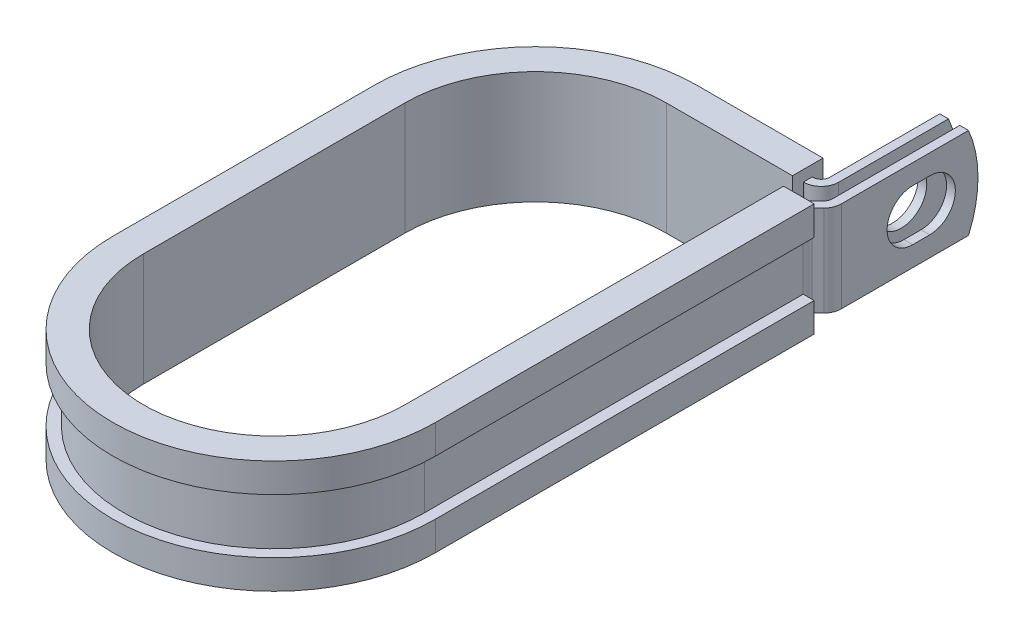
ISO-10303-21;
HEADER;
FILE_DESCRIPTION(('STEP AP214'),'2;1');
FILE_NAME('part.step','',(''),(''),'','','');
FILE_SCHEMA(('AUTOMOTIVE_DESIGN { 1 0 10303 214 1 1 1 1 }'));
ENDSEC;
DATA;
#1=APPLICATION_CONTEXT('core data for automotive mechanical design processes');
#2=APPLICATION_PROTOCOL_DEFINITION('international standard','automotive_design',2000,#1);
#3=PRODUCT_CONTEXT('',#1,'mechanical');
#4=PRODUCT('Part','Part','',(#3));
#5=PRODUCT_RELATED_PRODUCT_CATEGORY('part','',(#4));
#6=PRODUCT_DEFINITION_FORMATION('','',#4);
#7=PRODUCT_DEFINITION_CONTEXT('part definition',#1,'design');
#8=PRODUCT_DEFINITION('design','',#6,#7);
#9=PRODUCT_DEFINITION_SHAPE('','',#8);
#10=(LENGTH_UNIT() NAMED_UNIT(*) SI_UNIT(.MILLI.,.METRE.));
#11=(NAMED_UNIT(*) PLANE_ANGLE_UNIT() SI_UNIT($,.RADIAN.));
#12=(NAMED_UNIT(*) SI_UNIT($,.STERADIAN.) SOLID_ANGLE_UNIT());
#13=UNCERTAINTY_MEASURE_WITH_UNIT(LENGTH_MEASURE(1.E-05),#10,'distance_accuracy_value','');
#14=(GEOMETRIC_REPRESENTATION_CONTEXT(3) GLOBAL_UNCERTAINTY_ASSIGNED_CONTEXT((#13)) GLOBAL_UNIT_ASSIGNED_CONTEXT((#10,
#11,#12)) REPRESENTATION_CONTEXT('',''));
#15=CARTESIAN_POINT('',(0.,0.,0.));
#16=DIRECTION('',(0.,0.,1.));
#17=DIRECTION('',(1.,0.,0.));
#18=AXIS2_PLACEMENT_3D('',#15,#16,#17);
#19=CARTESIAN_POINT('',(20.4521698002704,-6.35,-19.7739));
#20=DIRECTION('',(0.,1.,0.));
#21=DIRECTION('',(1.,0.,0.));
#22=AXIS2_PLACEMENT_3D('',#19,#20,#21);
#23=PLANE('',#22);
#24=DIRECTION('',(0.,0.,-1.));
#25=VECTOR('',#24,1.);
#26=CARTESIAN_POINT('',(17.6073698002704,-6.35,-19.7739));
#27=LINE('',#26,#25);
#28=CARTESIAN_POINT('',(17.6073698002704,-6.35,-19.7739));
#29=VERTEX_POINT('',#28);
#30=CARTESIAN_POINT('',(17.6073698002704,-6.35,-20.9931));
#31=VERTEX_POINT('',#30);
#32=EDGE_CURVE('E582',#29,#31,#27,.T.);
#33=ORIENTED_EDGE('',*,*,#32,.T.);
#34=DIRECTION('',(1.,0.,0.));
#35=VECTOR('',#34,1.);
#36=CARTESIAN_POINT('',(0.,-6.35,-20.9931));
#37=LINE('',#36,#35);
#38=CARTESIAN_POINT('',(17.6581698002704,-6.35,-20.9931));
#39=VERTEX_POINT('',#38);
#40=EDGE_CURVE('E416',#39,#31,#37,.F.);
#41=ORIENTED_EDGE('',*,*,#40,.F.);
#42=CARTESIAN_POINT('',(17.6581698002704,-6.35,-22.2123));
#43=DIRECTION('',(0.,1.,0.));
#44=DIRECTION('',(1.,0.,0.));
#45=AXIS2_PLACEMENT_3D('',#42,#43,#44);
#46=CIRCLE('',#45,1.2192);
#47=CARTESIAN_POINT('',(18.8773698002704,-6.35,-22.2123));
#48=VERTEX_POINT('',#47);
#49=EDGE_CURVE('E414',#48,#39,#46,.F.);
#50=ORIENTED_EDGE('',*,*,#49,.F.);
#51=DIRECTION('',(0.,0.,1.));
#52=VECTOR('',#51,1.);
#53=CARTESIAN_POINT('',(18.8773698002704,-6.35,-38.862));
#54=LINE('',#53,#52);
#55=CARTESIAN_POINT('',(18.8773698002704,-6.35,-37.5366778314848));
#56=VERTEX_POINT('',#55);
#57=EDGE_CURVE('E412',#56,#48,#54,.T.);
#58=ORIENTED_EDGE('',*,*,#57,.F.);
#59=DIRECTION('',(-1.,0.,0.));
#60=VECTOR('',#59,1.);
#61=CARTESIAN_POINT('',(22.8905698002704,-6.35,-37.5366778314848));
#62=LINE('',#61,#60);
#63=CARTESIAN_POINT('',(20.0965698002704,-6.35,-37.5366778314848));
#64=VERTEX_POINT('',#63);
#65=EDGE_CURVE('E12',#64,#56,#62,.T.);
#66=ORIENTED_EDGE('',*,*,#65,.F.);
#67=DIRECTION('',(0.,0.,1.));
#68=VECTOR('',#67,1.);
#69=CARTESIAN_POINT('',(20.0965698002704,-6.35,-38.862));
#70=LINE('',#69,#68);
#71=CARTESIAN_POINT('',(20.0965698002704,-6.35,-22.2123));
#72=VERTEX_POINT('',#71);
#73=EDGE_CURVE('E410',#64,#72,#70,.T.);
#74=ORIENTED_EDGE('',*,*,#73,.T.);
#75=CARTESIAN_POINT('',(17.6581698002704,-6.35,-22.2123));
#76=DIRECTION('',(0.,-1.,0.));
#77=DIRECTION('',(0.,0.,1.));
#78=AXIS2_PLACEMENT_3D('',#75,#76,#77);
#79=CIRCLE('',#78,2.4384);
#80=CARTESIAN_POINT('',(17.6581698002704,-6.35,-19.7739));
#81=VERTEX_POINT('',#80);
#82=EDGE_CURVE('E407',#72,#81,#79,.T.);
#83=ORIENTED_EDGE('',*,*,#82,.T.);
#84=DIRECTION('',(-1.,0.,0.));
#85=VECTOR('',#84,1.);
#86=CARTESIAN_POINT('',(0.,-6.35,-19.7739));
#87=LINE('',#86,#85);
#88=EDGE_CURVE('E404',#81,#29,#87,.T.);
#89=ORIENTED_EDGE('',*,*,#88,.T.);
#90=EDGE_LOOP('',(#33,#41,#50,#58,#66,#74,#83,#89));
#91=FACE_BOUND('',#90,.T.);
#92=ADVANCED_FACE('F55',(#91),#23,.F.);
#93=CARTESIAN_POINT('',(20.4521698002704,6.35,-19.7739));
#94=DIRECTION('',(0.,1.,0.));
#95=DIRECTION('',(1.,0.,0.));
#96=AXIS2_PLACEMENT_3D('',#93,#94,#95);
#97=PLANE('',#96);
#98=DIRECTION('',(1.,0.,0.));
#99=VECTOR('',#98,1.);
#100=CARTESIAN_POINT('',(0.,6.35,-20.9931));
#101=LINE('',#100,#99);
#102=CARTESIAN_POINT('',(17.6581698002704,6.35,-20.9931));
#103=VERTEX_POINT('',#102);
#104=CARTESIAN_POINT('',(17.6073698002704,6.35,-20.9931));
#105=VERTEX_POINT('',#104);
#106=EDGE_CURVE('E377',#103,#105,#101,.F.);
#107=ORIENTED_EDGE('',*,*,#106,.T.);
#108=DIRECTION('',(0.,0.,1.));
#109=VECTOR('',#108,1.);
#110=CARTESIAN_POINT('',(17.6073698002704,6.35,-20.9931));
#111=LINE('',#110,#109);
#112=CARTESIAN_POINT('',(17.6073698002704,6.35,-19.7739));
#113=VERTEX_POINT('',#112);
#114=EDGE_CURVE('E588',#105,#113,#111,.T.);
#115=ORIENTED_EDGE('',*,*,#114,.T.);
#116=DIRECTION('',(-1.,0.,0.));
#117=VECTOR('',#116,1.);
#118=CARTESIAN_POINT('',(0.,6.35,-19.7739));
#119=LINE('',#118,#117);
#120=CARTESIAN_POINT('',(17.6581698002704,6.35,-19.7739));
#121=VERTEX_POINT('',#120);
#122=EDGE_CURVE('E479',#121,#113,#119,.T.);
#123=ORIENTED_EDGE('',*,*,#122,.F.);
#124=CARTESIAN_POINT('',(17.6581698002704,6.35,-22.2123));
#125=DIRECTION('',(0.,-1.,0.));
#126=DIRECTION('',(0.,0.,1.));
#127=AXIS2_PLACEMENT_3D('',#124,#125,#126);
#128=CIRCLE('',#127,2.4384);
#129=CARTESIAN_POINT('',(20.0965698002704,6.35,-22.2123));
#130=VERTEX_POINT('',#129);
#131=EDGE_CURVE('E474',#130,#121,#128,.T.);
#132=ORIENTED_EDGE('',*,*,#131,.F.);
#133=DIRECTION('',(0.,0.,1.));
#134=VECTOR('',#133,1.);
#135=CARTESIAN_POINT('',(20.0965698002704,6.35,-38.862));
#136=LINE('',#135,#134);
#137=CARTESIAN_POINT('',(20.0965698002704,6.35,-37.5366778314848));
#138=VERTEX_POINT('',#137);
#139=EDGE_CURVE('E468',#138,#130,#136,.T.);
#140=ORIENTED_EDGE('',*,*,#139,.F.);
#141=DIRECTION('',(-1.,0.,0.));
#142=VECTOR('',#141,1.);
#143=CARTESIAN_POINT('',(22.8905698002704,6.35,-37.5366778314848));
#144=LINE('',#143,#142);
#145=CARTESIAN_POINT('',(18.8773698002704,6.35,-37.5366778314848));
#146=VERTEX_POINT('',#145);
#147=EDGE_CURVE('E63',#138,#146,#144,.T.);
#148=ORIENTED_EDGE('',*,*,#147,.T.);
#149=DIRECTION('',(0.,0.,1.));
#150=VECTOR('',#149,1.);
#151=CARTESIAN_POINT('',(18.8773698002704,6.35,-38.862));
#152=LINE('',#151,#150);
#153=CARTESIAN_POINT('',(18.8773698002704,6.35,-22.2123));
#154=VERTEX_POINT('',#153);
#155=EDGE_CURVE('E465',#146,#154,#152,.T.);
#156=ORIENTED_EDGE('',*,*,#155,.T.);
#157=CARTESIAN_POINT('',(17.6581698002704,6.35,-22.2123));
#158=DIRECTION('',(0.,1.,0.));
#159=DIRECTION('',(1.,0.,0.));
#160=AXIS2_PLACEMENT_3D('',#157,#158,#159);
#161=CIRCLE('',#160,1.2192);
#162=EDGE_CURVE('E382',#154,#103,#161,.F.);
#163=ORIENTED_EDGE('',*,*,#162,.T.);
#164=EDGE_LOOP('',(#107,#115,#123,#132,#140,#148,#156,#163));
#165=FACE_BOUND('',#164,.T.);
#166=ADVANCED_FACE('F464',(#165),#97,.T.);
#167=CARTESIAN_POINT('',(0.,6.35,-19.7739));
#168=DIRECTION('',(0.,0.,1.));
#169=DIRECTION('',(1.,0.,0.));
#170=AXIS2_PLACEMENT_3D('',#167,#168,#169);
#171=PLANE('',#170);
#172=ORIENTED_EDGE('',*,*,#122,.T.);
#173=DIRECTION('',(0.,-1.,0.));
#174=VECTOR('',#173,1.);
#175=CARTESIAN_POINT('',(17.6073698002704,6.35,-19.7739));
#176=LINE('',#175,#174);
#177=EDGE_CURVE('E585',#113,#29,#176,.T.);
#178=ORIENTED_EDGE('',*,*,#177,.T.);
#179=ORIENTED_EDGE('',*,*,#88,.F.);
#180=DIRECTION('',(0.,-1.,0.));
#181=VECTOR('',#180,1.);
#182=CARTESIAN_POINT('',(17.6581698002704,6.35,-19.7739));
#183=LINE('',#182,#181);
#184=EDGE_CURVE('E452',#121,#81,#183,.T.);
#185=ORIENTED_EDGE('',*,*,#184,.F.);
#186=EDGE_LOOP('',(#172,#178,#179,#185));
#187=FACE_BOUND('',#186,.T.);
#188=ADVANCED_FACE('F789',(#187),#171,.T.);
#189=CARTESIAN_POINT('',(22.8905698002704,6.35,-19.7739));
#190=DIRECTION('',(-1.,0.,0.));
#191=DIRECTION('',(0.,0.,1.));
#192=AXIS2_PLACEMENT_3D('',#189,#190,#191);
#193=PLANE('',#192);
#194=CARTESIAN_POINT('',(22.8905698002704,0.,-32.1309999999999));
#195=DIRECTION('',(1.,0.,0.));
#196=DIRECTION('',(0.,0.,-1.));
#197=AXIS2_PLACEMENT_3D('',#194,#195,#196);
#198=CIRCLE('',#197,3.5687);
#199=CARTESIAN_POINT('',(22.8905698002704,-3.5687,-32.1310000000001));
#200=VERTEX_POINT('',#199);
#201=CARTESIAN_POINT('',(22.8905698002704,3.5687,-32.1310000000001));
#202=VERTEX_POINT('',#201);
#203=EDGE_CURVE('E527',#200,#202,#198,.T.);
#204=ORIENTED_EDGE('',*,*,#203,.F.);
#205=DIRECTION('',(0.,0.,-1.));
#206=VECTOR('',#205,1.);
#207=CARTESIAN_POINT('',(22.8905698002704,-3.5687,-29.7433999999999));
#208=LINE('',#207,#206);
#209=CARTESIAN_POINT('',(22.8905698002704,-3.5687,-29.7433999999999));
#210=VERTEX_POINT('',#209);
#211=EDGE_CURVE('E524',#210,#200,#208,.T.);
#212=ORIENTED_EDGE('',*,*,#211,.F.);
#213=CARTESIAN_POINT('',(22.8905698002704,0.,-29.7433999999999));
#214=DIRECTION('',(1.,0.,0.));
#215=DIRECTION('',(0.,0.,-1.));
#216=AXIS2_PLACEMENT_3D('',#213,#214,#215);
#217=CIRCLE('',#216,3.5687);
#218=CARTESIAN_POINT('',(22.8905698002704,3.5687,-29.7433999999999));
#219=VERTEX_POINT('',#218);
#220=EDGE_CURVE('E521',#219,#210,#217,.T.);
#221=ORIENTED_EDGE('',*,*,#220,.F.);
#222=DIRECTION('',(0.,0.,1.));
#223=VECTOR('',#222,1.);
#224=CARTESIAN_POINT('',(22.8905698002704,3.5687,-29.7433999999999));
#225=LINE('',#224,#223);
#226=EDGE_CURVE('E520',#202,#219,#225,.T.);
#227=ORIENTED_EDGE('',*,*,#226,.F.);
#228=EDGE_LOOP('',(#204,#212,#221,#227));
#229=FACE_BOUND('',#228,.T.);
#230=DIRECTION('',(0.,0.,-1.));
#231=VECTOR('',#230,1.);
#232=CARTESIAN_POINT('',(22.8905698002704,-6.35,-19.7739));
#233=LINE('',#232,#231);
#234=CARTESIAN_POINT('',(22.8905698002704,-6.35,-19.7739));
#235=VERTEX_POINT('',#234);
#236=CARTESIAN_POINT('',(22.8905698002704,-6.35,-37.5366778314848));
#237=VERTEX_POINT('',#236);
#238=EDGE_CURVE('E388',#235,#237,#233,.T.);
#239=ORIENTED_EDGE('',*,*,#238,.T.);
#240=CARTESIAN_POINT('',(22.8905698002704,0.,-22.987));
#241=DIRECTION('',(-1.,0.,0.));
#242=DIRECTION('',(0.,0.,1.));
#243=AXIS2_PLACEMENT_3D('',#240,#241,#242);
#244=CIRCLE('',#243,15.875);
#245=CARTESIAN_POINT('',(22.8905698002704,6.35,-37.5366778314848));
#246=VERTEX_POINT('',#245);
#247=EDGE_CURVE('E536',#246,#237,#244,.T.);
#248=ORIENTED_EDGE('',*,*,#247,.F.);
#249=DIRECTION('',(0.,0.,-1.));
#250=VECTOR('',#249,1.);
#251=CARTESIAN_POINT('',(22.8905698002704,6.35,-19.7739));
#252=LINE('',#251,#250);
#253=CARTESIAN_POINT('',(22.8905698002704,6.35,-19.7739));
#254=VERTEX_POINT('',#253);
#255=EDGE_CURVE('E425',#254,#246,#252,.T.);
#256=ORIENTED_EDGE('',*,*,#255,.F.);
#257=DIRECTION('',(0.,-1.,0.));
#258=VECTOR('',#257,1.);
#259=CARTESIAN_POINT('',(22.8905698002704,6.35,-19.7739));
#260=LINE('',#259,#258);
#261=EDGE_CURVE('E387',#254,#235,#260,.T.);
#262=ORIENTED_EDGE('',*,*,#261,.T.);
#263=EDGE_LOOP('',(#239,#248,#256,#262));
#264=FACE_BOUND('',#263,.T.);
#265=ADVANCED_FACE('F57',(#229,#264),#193,.F.);
#266=CARTESIAN_POINT('',(21.6713698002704,6.35,-19.7739));
#267=DIRECTION('',(-1.,0.,0.));
#268=DIRECTION('',(0.,0.,1.));
#269=AXIS2_PLACEMENT_3D('',#266,#267,#268);
#270=PLANE('',#269);
#271=DIRECTION('',(0.,0.,-1.));
#272=VECTOR('',#271,1.);
#273=CARTESIAN_POINT('',(21.6713698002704,-3.5687,-29.7433999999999));
#274=LINE('',#273,#272);
#275=CARTESIAN_POINT('',(21.6713698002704,-3.5687,-29.7433999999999));
#276=VERTEX_POINT('',#275);
#277=CARTESIAN_POINT('',(21.6713698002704,-3.5687,-32.1310000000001));
#278=VERTEX_POINT('',#277);
#279=EDGE_CURVE('E505',#276,#278,#274,.T.);
#280=ORIENTED_EDGE('',*,*,#279,.T.);
#281=CARTESIAN_POINT('',(21.6713698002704,0.,-32.1309999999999));
#282=DIRECTION('',(-1.,0.,0.));
#283=DIRECTION('',(0.,0.,1.));
#284=AXIS2_PLACEMENT_3D('',#281,#282,#283);
#285=CIRCLE('',#284,3.5687);
#286=CARTESIAN_POINT('',(21.6713698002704,3.5687,-32.1310000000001));
#287=VERTEX_POINT('',#286);
#288=EDGE_CURVE('E504',#278,#287,#285,.F.);
#289=ORIENTED_EDGE('',*,*,#288,.T.);
#290=DIRECTION('',(0.,0.,1.));
#291=VECTOR('',#290,1.);
#292=CARTESIAN_POINT('',(21.6713698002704,3.5687,-29.7433999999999));
#293=LINE('',#292,#291);
#294=CARTESIAN_POINT('',(21.6713698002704,3.5687,-29.7433999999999));
#295=VERTEX_POINT('',#294);
#296=EDGE_CURVE('E508',#287,#295,#293,.T.);
#297=ORIENTED_EDGE('',*,*,#296,.T.);
#298=CARTESIAN_POINT('',(21.6713698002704,0.,-29.7433999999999));
#299=DIRECTION('',(-1.,0.,0.));
#300=DIRECTION('',(0.,0.,1.));
#301=AXIS2_PLACEMENT_3D('',#298,#299,#300);
#302=CIRCLE('',#301,3.5687);
#303=EDGE_CURVE('E501',#295,#276,#302,.F.);
#304=ORIENTED_EDGE('',*,*,#303,.T.);
#305=EDGE_LOOP('',(#280,#289,#297,#304));
#306=FACE_BOUND('',#305,.T.);
#307=CARTESIAN_POINT('',(21.6713698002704,0.,-22.987));
#308=DIRECTION('',(-1.,0.,0.));
#309=DIRECTION('',(0.,0.,1.));
#310=AXIS2_PLACEMENT_3D('',#307,#308,#309);
#311=CIRCLE('',#310,15.875);
#312=CARTESIAN_POINT('',(21.6713698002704,6.35,-37.5366778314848));
#313=VERTEX_POINT('',#312);
#314=CARTESIAN_POINT('',(21.6713698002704,-6.35,-37.5366778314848));
#315=VERTEX_POINT('',#314);
#316=EDGE_CURVE('E77',#313,#315,#311,.T.);
#317=ORIENTED_EDGE('',*,*,#316,.T.);
#318=DIRECTION('',(0.,0.,-1.));
#319=VECTOR('',#318,1.);
#320=CARTESIAN_POINT('',(21.6713698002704,-6.35,-19.7739));
#321=LINE('',#320,#319);
#322=CARTESIAN_POINT('',(21.6713698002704,-6.35,-19.7739));
#323=VERTEX_POINT('',#322);
#324=EDGE_CURVE('E391',#323,#315,#321,.T.);
#325=ORIENTED_EDGE('',*,*,#324,.F.);
#326=DIRECTION('',(0.,-1.,0.));
#327=VECTOR('',#326,1.);
#328=CARTESIAN_POINT('',(21.6713698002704,6.35,-19.7739));
#329=LINE('',#328,#327);
#330=CARTESIAN_POINT('',(21.6713698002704,6.35,-19.7739));
#331=VERTEX_POINT('',#330);
#332=EDGE_CURVE('E460',#331,#323,#329,.T.);
#333=ORIENTED_EDGE('',*,*,#332,.F.);
#334=DIRECTION('',(0.,0.,-1.));
#335=VECTOR('',#334,1.);
#336=CARTESIAN_POINT('',(21.6713698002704,6.35,-19.7739));
#337=LINE('',#336,#335);
#338=EDGE_CURVE('E489',#331,#313,#337,.T.);
#339=ORIENTED_EDGE('',*,*,#338,.T.);
#340=EDGE_LOOP('',(#317,#325,#333,#339));
#341=FACE_BOUND('',#340,.T.);
#342=ADVANCED_FACE('F762',(#306,#341),#270,.T.);
#343=CARTESIAN_POINT('',(20.0965698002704,6.35,-38.862));
#344=DIRECTION('',(1.,0.,0.));
#345=DIRECTION('',(0.,0.,-1.));
#346=AXIS2_PLACEMENT_3D('',#343,#344,#345);
#347=PLANE('',#346);
#348=CARTESIAN_POINT('',(20.0965698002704,0.,-30.9372));
#349=DIRECTION('',(1.,0.,0.));
#350=DIRECTION('',(0.,0.,-1.));
#351=AXIS2_PLACEMENT_3D('',#348,#349,#350);
#352=CIRCLE('',#351,3.5687);
#353=CARTESIAN_POINT('',(20.0965698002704,0.,-34.5059));
#354=VERTEX_POINT('',#353);
#355=EDGE_CURVE('E392',#354,#354,#352,.F.);
#356=ORIENTED_EDGE('',*,*,#355,.T.);
#357=EDGE_LOOP('',(#356));
#358=FACE_BOUND('',#357,.T.);
#359=ORIENTED_EDGE('',*,*,#73,.F.);
#360=CARTESIAN_POINT('',(20.0965698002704,0.,-22.987));
#361=DIRECTION('',(1.,0.,0.));
#362=DIRECTION('',(0.,0.,-1.));
#363=AXIS2_PLACEMENT_3D('',#360,#361,#362);
#364=CIRCLE('',#363,15.875);
#365=EDGE_CURVE('E532',#64,#138,#364,.T.);
#366=ORIENTED_EDGE('',*,*,#365,.T.);
#367=ORIENTED_EDGE('',*,*,#139,.T.);
#368=DIRECTION('',(0.,-1.,0.));
#369=VECTOR('',#368,1.);
#370=CARTESIAN_POINT('',(20.0965698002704,6.35,-22.2123));
#371=LINE('',#370,#369);
#372=EDGE_CURVE('E449',#130,#72,#371,.T.);
#373=ORIENTED_EDGE('',*,*,#372,.T.);
#374=EDGE_LOOP('',(#359,#366,#367,#373));
#375=FACE_BOUND('',#374,.T.);
#376=ADVANCED_FACE('F797',(#358,#375),#347,.T.);
#377=CARTESIAN_POINT('',(18.8773698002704,6.35,-38.862));
#378=DIRECTION('',(1.,0.,0.));
#379=DIRECTION('',(0.,0.,-1.));
#380=AXIS2_PLACEMENT_3D('',#377,#378,#379);
#381=PLANE('',#380);
#382=CARTESIAN_POINT('',(18.8773698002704,0.,-30.9372));
#383=DIRECTION('',(-1.,0.,0.));
#384=DIRECTION('',(0.,0.,1.));
#385=AXIS2_PLACEMENT_3D('',#382,#383,#384);
#386=CIRCLE('',#385,3.5687);
#387=CARTESIAN_POINT('',(18.8773698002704,0.,-27.3685));
#388=VERTEX_POINT('',#387);
#389=EDGE_CURVE('E496',#388,#388,#386,.T.);
#390=ORIENTED_EDGE('',*,*,#389,.F.);
#391=EDGE_LOOP('',(#390));
#392=FACE_BOUND('',#391,.T.);
#393=CARTESIAN_POINT('',(18.8773698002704,0.,-22.987));
#394=DIRECTION('',(-1.,0.,0.));
#395=DIRECTION('',(0.,0.,1.));
#396=AXIS2_PLACEMENT_3D('',#393,#394,#395);
#397=CIRCLE('',#396,15.875);
#398=EDGE_CURVE('E69',#146,#56,#397,.T.);
#399=ORIENTED_EDGE('',*,*,#398,.T.);
#400=ORIENTED_EDGE('',*,*,#57,.T.);
#401=DIRECTION('',(0.,-1.,0.));
#402=VECTOR('',#401,1.);
#403=CARTESIAN_POINT('',(18.8773698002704,6.35,-22.2123));
#404=LINE('',#403,#402);
#405=EDGE_CURVE('E446',#154,#48,#404,.T.);
#406=ORIENTED_EDGE('',*,*,#405,.F.);
#407=ORIENTED_EDGE('',*,*,#155,.F.);
#408=EDGE_LOOP('',(#399,#400,#406,#407));
#409=FACE_BOUND('',#408,.T.);
#410=ADVANCED_FACE('F471',(#392,#409),#381,.F.);
#411=CARTESIAN_POINT('',(22.2123,-6.35,-16.3614026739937));
#412=DIRECTION('',(0.,1.,0.));
#413=DIRECTION('',(1.,0.,0.));
#414=AXIS2_PLACEMENT_3D('',#411,#412,#413);
#415=CIRCLE('',#414,1.2192);
#416=CARTESIAN_POINT('',(20.9931,-6.35,-16.3614026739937));
#417=VERTEX_POINT('',#416);
#418=CARTESIAN_POINT('',(21.3501954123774,-6.35,-17.2235072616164));
#419=VERTEX_POINT('',#418);
#420=EDGE_CURVE('E419',#417,#419,#415,.F.);
#421=ORIENTED_EDGE('',*,*,#420,.F.);
#422=DIRECTION('',(1.,0.,0.));
#423=VECTOR('',#422,1.);
#424=CARTESIAN_POINT('',(19.7739,-6.35,-16.3614026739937));
#425=LINE('',#424,#423);
#426=CARTESIAN_POINT('',(19.7739,-6.35,-16.3614026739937));
#427=VERTEX_POINT('',#426);
#428=EDGE_CURVE('E370',#427,#417,#425,.T.);
#429=ORIENTED_EDGE('',*,*,#428,.F.);
#430=CARTESIAN_POINT('',(22.2123,-6.35,-16.3614026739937));
#431=DIRECTION('',(0.,-1.,0.));
#432=DIRECTION('',(0.,0.,1.));
#433=AXIS2_PLACEMENT_3D('',#430,#431,#432);
#434=CIRCLE('',#433,2.4384);
#435=CARTESIAN_POINT('',(20.4880908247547,-6.35,-18.085611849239));
#436=VERTEX_POINT('',#435);
#437=EDGE_CURVE('E401',#427,#436,#434,.T.);
#438=ORIENTED_EDGE('',*,*,#437,.T.);
#439=DIRECTION('',(0.707106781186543,0.,-0.707106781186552));
#440=VECTOR('',#439,1.);
#441=CARTESIAN_POINT('',(20.4880908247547,-6.35,-18.085611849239));
#442=LINE('',#441,#440);
#443=CARTESIAN_POINT('',(21.3142743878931,-6.35,-18.9117954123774));
#444=VERTEX_POINT('',#443);
#445=EDGE_CURVE('E398',#436,#444,#442,.T.);
#446=ORIENTED_EDGE('',*,*,#445,.T.);
#447=CARTESIAN_POINT('',(20.4521698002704,-6.35,-19.7739));
#448=DIRECTION('',(0.,1.,0.));
#449=DIRECTION('',(0.,0.,1.));
#450=AXIS2_PLACEMENT_3D('',#447,#448,#449);
#451=CIRCLE('',#450,1.2192);
#452=EDGE_CURVE('E395',#444,#323,#451,.T.);
#453=ORIENTED_EDGE('',*,*,#452,.T.);
#454=ORIENTED_EDGE('',*,*,#324,.T.);
#455=DIRECTION('',(-1.,0.,0.));
#456=VECTOR('',#455,1.);
#457=CARTESIAN_POINT('',(22.8905698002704,-6.35,-37.5366778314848));
#458=LINE('',#457,#456);
#459=EDGE_CURVE('E538',#237,#315,#458,.T.);
#460=ORIENTED_EDGE('',*,*,#459,.F.);
#461=ORIENTED_EDGE('',*,*,#238,.F.);
#462=CARTESIAN_POINT('',(20.4521698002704,-6.35,-19.7739));
#463=DIRECTION('',(0.,1.,0.));
#464=DIRECTION('',(1.,0.,0.));
#465=AXIS2_PLACEMENT_3D('',#462,#463,#464);
#466=CIRCLE('',#465,2.4384);
#467=CARTESIAN_POINT('',(22.1763789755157,-6.35,-18.0496908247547));
#468=VERTEX_POINT('',#467);
#469=EDGE_CURVE('E423',#468,#235,#466,.T.);
#470=ORIENTED_EDGE('',*,*,#469,.F.);
#471=DIRECTION('',(0.707106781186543,0.,-0.707106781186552));
#472=VECTOR('',#471,1.);
#473=CARTESIAN_POINT('',(21.3501954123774,-6.35,-17.2235072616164));
#474=LINE('',#473,#472);
#475=EDGE_CURVE('E421',#419,#468,#474,.T.);
#476=ORIENTED_EDGE('',*,*,#475,.F.);
#477=EDGE_LOOP('',(#421,#429,#438,#446,#453,#454,#460,#461,#470,#476));
#478=FACE_BOUND('',#477,.T.);
#479=ADVANCED_FACE('F743',(#478),#23,.F.);
#480=DIRECTION('',(-1.,0.,0.));
#481=VECTOR('',#480,1.);
#482=CARTESIAN_POINT('',(20.9931,6.35,-16.3614026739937));
#483=LINE('',#482,#481);
#484=CARTESIAN_POINT('',(20.9931,6.35,-16.3614026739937));
#485=VERTEX_POINT('',#484);
#486=CARTESIAN_POINT('',(19.7739,6.35,-16.3614026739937));
#487=VERTEX_POINT('',#486);
#488=EDGE_CURVE('E350',#485,#487,#483,.T.);
#489=ORIENTED_EDGE('',*,*,#488,.F.);
#490=CARTESIAN_POINT('',(22.2123,6.35,-16.3614026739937));
#491=DIRECTION('',(0.,1.,0.));
#492=DIRECTION('',(1.,0.,0.));
#493=AXIS2_PLACEMENT_3D('',#490,#491,#492);
#494=CIRCLE('',#493,1.2192);
#495=CARTESIAN_POINT('',(21.3501954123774,6.35,-17.2235072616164));
#496=VERTEX_POINT('',#495);
#497=EDGE_CURVE('E365',#485,#496,#494,.F.);
#498=ORIENTED_EDGE('',*,*,#497,.T.);
#499=DIRECTION('',(0.707106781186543,0.,-0.707106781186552));
#500=VECTOR('',#499,1.);
#501=CARTESIAN_POINT('',(21.3501954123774,6.35,-17.2235072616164));
#502=LINE('',#501,#500);
#503=CARTESIAN_POINT('',(22.1763789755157,6.35,-18.0496908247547));
#504=VERTEX_POINT('',#503);
#505=EDGE_CURVE('E376',#496,#504,#502,.T.);
#506=ORIENTED_EDGE('',*,*,#505,.T.);
#507=CARTESIAN_POINT('',(20.4521698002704,6.35,-19.7739));
#508=DIRECTION('',(0.,1.,0.));
#509=DIRECTION('',(1.,0.,0.));
#510=AXIS2_PLACEMENT_3D('',#507,#508,#509);
#511=CIRCLE('',#510,2.4384);
#512=EDGE_CURVE('E379',#504,#254,#511,.T.);
#513=ORIENTED_EDGE('',*,*,#512,.T.);
#514=ORIENTED_EDGE('',*,*,#255,.T.);
#515=DIRECTION('',(-1.,0.,0.));
#516=VECTOR('',#515,1.);
#517=CARTESIAN_POINT('',(22.8905698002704,6.35,-37.5366778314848));
#518=LINE('',#517,#516);
#519=EDGE_CURVE('E534',#246,#313,#518,.T.);
#520=ORIENTED_EDGE('',*,*,#519,.T.);
#521=ORIENTED_EDGE('',*,*,#338,.F.);
#522=CARTESIAN_POINT('',(20.4521698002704,6.35,-19.7739));
#523=DIRECTION('',(0.,1.,0.));
#524=DIRECTION('',(0.,0.,1.));
#525=AXIS2_PLACEMENT_3D('',#522,#523,#524);
#526=CIRCLE('',#525,1.2192);
#527=CARTESIAN_POINT('',(21.3142743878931,6.35,-18.9117954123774));
#528=VERTEX_POINT('',#527);
#529=EDGE_CURVE('E486',#528,#331,#526,.T.);
#530=ORIENTED_EDGE('',*,*,#529,.F.);
#531=DIRECTION('',(0.707106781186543,0.,-0.707106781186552));
#532=VECTOR('',#531,1.);
#533=CARTESIAN_POINT('',(20.4880908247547,6.35,-18.085611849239));
#534=LINE('',#533,#532);
#535=CARTESIAN_POINT('',(20.4880908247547,6.35,-18.085611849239));
#536=VERTEX_POINT('',#535);
#537=EDGE_CURVE('E483',#536,#528,#534,.T.);
#538=ORIENTED_EDGE('',*,*,#537,.F.);
#539=CARTESIAN_POINT('',(22.2123,6.35,-16.3614026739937));
#540=DIRECTION('',(0.,-1.,0.));
#541=DIRECTION('',(0.,0.,1.));
#542=AXIS2_PLACEMENT_3D('',#539,#540,#541);
#543=CIRCLE('',#542,2.4384);
#544=EDGE_CURVE('E369',#487,#536,#543,.T.);
#545=ORIENTED_EDGE('',*,*,#544,.F.);
#546=EDGE_LOOP('',(#489,#498,#506,#513,#514,#520,#521,#530,#538,#545));
#547=FACE_BOUND('',#546,.T.);
#548=ADVANCED_FACE('F364',(#547),#97,.T.);
#549=CARTESIAN_POINT('',(20.4521698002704,6.35,-19.7739));
#550=DIRECTION('',(0.,-1.,0.));
#551=DIRECTION('',(0.,0.,-1.));
#552=AXIS2_PLACEMENT_3D('',#549,#550,#551);
#553=CYLINDRICAL_SURFACE('',#552,1.2192);
#554=ORIENTED_EDGE('',*,*,#452,.F.);
#555=DIRECTION('',(0.,-1.,0.));
#556=VECTOR('',#555,1.);
#557=CARTESIAN_POINT('',(21.3142743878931,6.35,-18.9117954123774));
#558=LINE('',#557,#556);
#559=EDGE_CURVE('E458',#528,#444,#558,.T.);
#560=ORIENTED_EDGE('',*,*,#559,.F.);
#561=ORIENTED_EDGE('',*,*,#529,.T.);
#562=ORIENTED_EDGE('',*,*,#332,.T.);
#563=EDGE_LOOP('',(#554,#560,#561,#562));
#564=FACE_BOUND('',#563,.T.);
#565=ADVANCED_FACE('F765',(#564),#553,.F.);
#566=CARTESIAN_POINT('',(20.4880908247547,6.35,-18.085611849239));
#567=DIRECTION('',(-0.707106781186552,0.,-0.707106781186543));
#568=DIRECTION('',(-0.707106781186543,0.,0.707106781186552));
#569=AXIS2_PLACEMENT_3D('',#566,#567,#568);
#570=PLANE('',#569);
#571=ORIENTED_EDGE('',*,*,#445,.F.);
#572=DIRECTION('',(0.,-1.,0.));
#573=VECTOR('',#572,1.);
#574=CARTESIAN_POINT('',(20.4880908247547,6.35,-18.085611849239));
#575=LINE('',#574,#573);
#576=EDGE_CURVE('E456',#536,#436,#575,.T.);
#577=ORIENTED_EDGE('',*,*,#576,.F.);
#578=ORIENTED_EDGE('',*,*,#537,.T.);
#579=ORIENTED_EDGE('',*,*,#559,.T.);
#580=EDGE_LOOP('',(#571,#577,#578,#579));
#581=FACE_BOUND('',#580,.T.);
#582=ADVANCED_FACE('F768',(#581),#570,.T.);
#583=CARTESIAN_POINT('',(22.2123,6.35,-16.3614026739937));
#584=DIRECTION('',(0.,-1.,0.));
#585=DIRECTION('',(0.,0.,-1.));
#586=AXIS2_PLACEMENT_3D('',#583,#584,#585);
#587=CYLINDRICAL_SURFACE('',#586,2.4384);
#588=ORIENTED_EDGE('',*,*,#437,.F.);
#589=DIRECTION('',(0.,-1.,0.));
#590=VECTOR('',#589,1.);
#591=CARTESIAN_POINT('',(19.7739,6.35,-16.3614026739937));
#592=LINE('',#591,#590);
#593=EDGE_CURVE('E454',#487,#427,#592,.T.);
#594=ORIENTED_EDGE('',*,*,#593,.F.);
#595=ORIENTED_EDGE('',*,*,#544,.T.);
#596=ORIENTED_EDGE('',*,*,#576,.T.);
#597=EDGE_LOOP('',(#588,#594,#595,#596));
#598=FACE_BOUND('',#597,.T.);
#599=ADVANCED_FACE('F770',(#598),#587,.T.);
#600=CARTESIAN_POINT('',(17.6581698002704,6.35,-22.2123));
#601=DIRECTION('',(0.,-1.,0.));
#602=DIRECTION('',(0.,0.,-1.));
#603=AXIS2_PLACEMENT_3D('',#600,#601,#602);
#604=CYLINDRICAL_SURFACE('',#603,2.4384);
#605=ORIENTED_EDGE('',*,*,#82,.F.);
#606=ORIENTED_EDGE('',*,*,#372,.F.);
#607=ORIENTED_EDGE('',*,*,#131,.T.);
#608=ORIENTED_EDGE('',*,*,#184,.T.);
#609=EDGE_LOOP('',(#605,#606,#607,#608));
#610=FACE_BOUND('',#609,.T.);
#611=ADVANCED_FACE('F772',(#610),#604,.T.);
#612=CARTESIAN_POINT('',(17.6581698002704,6.35,-22.2123));
#613=DIRECTION('',(0.,-1.,0.));
#614=DIRECTION('',(0.,0.,-1.));
#615=AXIS2_PLACEMENT_3D('',#612,#613,#614);
#616=CYLINDRICAL_SURFACE('',#615,1.2192);
#617=ORIENTED_EDGE('',*,*,#49,.T.);
#618=DIRECTION('',(0.,-1.,0.));
#619=VECTOR('',#618,1.);
#620=CARTESIAN_POINT('',(17.6581698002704,6.35,-20.9931));
#621=LINE('',#620,#619);
#622=EDGE_CURVE('E443',#103,#39,#621,.T.);
#623=ORIENTED_EDGE('',*,*,#622,.F.);
#624=ORIENTED_EDGE('',*,*,#162,.F.);
#625=ORIENTED_EDGE('',*,*,#405,.T.);
#626=EDGE_LOOP('',(#617,#623,#624,#625));
#627=FACE_BOUND('',#626,.T.);
#628=ADVANCED_FACE('F778',(#627),#616,.F.);
#629=CARTESIAN_POINT('',(0.,6.35,-20.9931));
#630=DIRECTION('',(0.,0.,1.));
#631=DIRECTION('',(1.,0.,0.));
#632=AXIS2_PLACEMENT_3D('',#629,#630,#631);
#633=PLANE('',#632);
#634=DIRECTION('',(0.,-1.,0.));
#635=VECTOR('',#634,1.);
#636=CARTESIAN_POINT('',(0.,6.35,-20.9931));
#637=LINE('',#636,#635);
#638=CARTESIAN_POINT('',(0.,3.81,-20.9931));
#639=VERTEX_POINT('',#638);
#640=CARTESIAN_POINT('',(0.,-3.81,-20.9931));
#641=VERTEX_POINT('',#640);
#642=EDGE_CURVE('E440',#639,#641,#637,.T.);
#643=ORIENTED_EDGE('',*,*,#642,.F.);
#644=DIRECTION('',(1.,0.,0.));
#645=VECTOR('',#644,1.);
#646=CARTESIAN_POINT('',(0.,3.81,-20.9931));
#647=LINE('',#646,#645);
#648=CARTESIAN_POINT('',(17.6073698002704,3.81,-20.9931));
#649=VERTEX_POINT('',#648);
#650=EDGE_CURVE('E541',#639,#649,#647,.T.);
#651=ORIENTED_EDGE('',*,*,#650,.T.);
#652=DIRECTION('',(0.,1.,0.));
#653=VECTOR('',#652,1.);
#654=CARTESIAN_POINT('',(17.6073698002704,6.35,-20.9931));
#655=LINE('',#654,#653);
#656=EDGE_CURVE('E591',#649,#105,#655,.T.);
#657=ORIENTED_EDGE('',*,*,#656,.T.);
#658=ORIENTED_EDGE('',*,*,#106,.F.);
#659=ORIENTED_EDGE('',*,*,#622,.T.);
#660=ORIENTED_EDGE('',*,*,#40,.T.);
#661=DIRECTION('',(0.,1.,0.));
#662=VECTOR('',#661,1.);
#663=CARTESIAN_POINT('',(17.6073698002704,-6.35,-20.9931));
#664=LINE('',#663,#662);
#665=CARTESIAN_POINT('',(17.6073698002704,-3.81,-20.9931));
#666=VERTEX_POINT('',#665);
#667=EDGE_CURVE('E579',#31,#666,#664,.T.);
#668=ORIENTED_EDGE('',*,*,#667,.T.);
#669=DIRECTION('',(1.,0.,0.));
#670=VECTOR('',#669,1.);
#671=CARTESIAN_POINT('',(0.,-3.81,-20.9931));
#672=LINE('',#671,#670);
#673=EDGE_CURVE('E562',#641,#666,#672,.T.);
#674=ORIENTED_EDGE('',*,*,#673,.F.);
#675=EDGE_LOOP('',(#643,#651,#657,#658,#659,#660,#668,#674));
#676=FACE_BOUND('',#675,.T.);
#677=ADVANCED_FACE('F830',(#676),#633,.F.);
#678=CARTESIAN_POINT('',(0.,6.35,0.));
#679=DIRECTION('',(0.,-1.,0.));
#680=DIRECTION('',(0.,0.,-1.));
#681=AXIS2_PLACEMENT_3D('',#678,#679,#680);
#682=CYLINDRICAL_SURFACE('',#681,20.9931);
#683=DIRECTION('',(0.,-1.,0.));
#684=VECTOR('',#683,1.);
#685=CARTESIAN_POINT('',(-20.9931,6.35,0.));
#686=LINE('',#685,#684);
#687=CARTESIAN_POINT('',(-20.9931,3.81,0.));
#688=VERTEX_POINT('',#687);
#689=CARTESIAN_POINT('',(-20.9931,-3.81,0.));
#690=VERTEX_POINT('',#689);
#691=EDGE_CURVE('E437',#688,#690,#686,.T.);
#692=ORIENTED_EDGE('',*,*,#691,.F.);
#693=CARTESIAN_POINT('',(0.,3.81,0.));
#694=DIRECTION('',(0.,-1.,0.));
#695=DIRECTION('',(0.,0.,-1.));
#696=AXIS2_PLACEMENT_3D('',#693,#694,#695);
#697=CIRCLE('',#696,20.9931);
#698=EDGE_CURVE('E594',#688,#639,#697,.T.);
#699=ORIENTED_EDGE('',*,*,#698,.T.);
#700=ORIENTED_EDGE('',*,*,#642,.T.);
#701=CARTESIAN_POINT('',(0.,-3.81,0.));
#702=DIRECTION('',(0.,-1.,0.));
#703=DIRECTION('',(0.,0.,-1.));
#704=AXIS2_PLACEMENT_3D('',#701,#702,#703);
#705=CIRCLE('',#704,20.9931);
#706=EDGE_CURVE('E615',#690,#641,#705,.T.);
#707=ORIENTED_EDGE('',*,*,#706,.F.);
#708=EDGE_LOOP('',(#692,#699,#700,#707));
#709=FACE_BOUND('',#708,.T.);
#710=ADVANCED_FACE('F841',(#709),#682,.T.);
#711=CARTESIAN_POINT('',(-20.9931,6.35,0.));
#712=DIRECTION('',(1.,0.,0.));
#713=DIRECTION('',(0.,0.,-1.));
#714=AXIS2_PLACEMENT_3D('',#711,#712,#713);
#715=PLANE('',#714);
#716=DIRECTION('',(0.,-1.,0.));
#717=VECTOR('',#716,1.);
#718=CARTESIAN_POINT('',(-20.9931,6.35,36.4998));
#719=LINE('',#718,#717);
#720=CARTESIAN_POINT('',(-20.9931,3.81,36.4998));
#721=VERTEX_POINT('',#720);
#722=CARTESIAN_POINT('',(-20.9931,-3.81,36.4998));
#723=VERTEX_POINT('',#722);
#724=EDGE_CURVE('E434',#721,#723,#719,.T.);
#725=ORIENTED_EDGE('',*,*,#724,.F.);
#726=DIRECTION('',(0.,0.,-1.));
#727=VECTOR('',#726,1.);
#728=CARTESIAN_POINT('',(-20.9931,3.81,36.4998));
#729=LINE('',#728,#727);
#730=EDGE_CURVE('E626',#721,#688,#729,.T.);
#731=ORIENTED_EDGE('',*,*,#730,.T.);
#732=ORIENTED_EDGE('',*,*,#691,.T.);
#733=DIRECTION('',(0.,0.,-1.));
#734=VECTOR('',#733,1.);
#735=CARTESIAN_POINT('',(-20.9931,-3.81,36.4998));
#736=LINE('',#735,#734);
#737=EDGE_CURVE('E647',#723,#690,#736,.T.);
#738=ORIENTED_EDGE('',*,*,#737,.F.);
#739=EDGE_LOOP('',(#725,#731,#732,#738));
#740=FACE_BOUND('',#739,.T.);
#741=ADVANCED_FACE('F846',(#740),#715,.F.);
#742=CARTESIAN_POINT('',(0.,6.35,36.4998));
#743=DIRECTION('',(0.,-1.,0.));
#744=DIRECTION('',(0.,0.,-1.));
#745=AXIS2_PLACEMENT_3D('',#742,#743,#744);
#746=CYLINDRICAL_SURFACE('',#745,20.9931);
#747=DIRECTION('',(0.,-1.,0.));
#748=VECTOR('',#747,1.);
#749=CARTESIAN_POINT('',(20.9931,6.35,36.4998));
#750=LINE('',#749,#748);
#751=CARTESIAN_POINT('',(20.9931,3.81,36.4998));
#752=VERTEX_POINT('',#751);
#753=CARTESIAN_POINT('',(20.9931,-3.81,36.4998));
#754=VERTEX_POINT('',#753);
#755=EDGE_CURVE('E359',#752,#754,#750,.T.);
#756=ORIENTED_EDGE('',*,*,#755,.F.);
#757=CARTESIAN_POINT('',(0.,3.81,36.4998));
#758=DIRECTION('',(0.,-1.,0.));
#759=DIRECTION('',(0.,0.,-1.));
#760=AXIS2_PLACEMENT_3D('',#757,#758,#759);
#761=CIRCLE('',#760,20.9931);
#762=EDGE_CURVE('E658',#752,#721,#761,.T.);
#763=ORIENTED_EDGE('',*,*,#762,.T.);
#764=ORIENTED_EDGE('',*,*,#724,.T.);
#765=CARTESIAN_POINT('',(0.,-3.81,36.4998));
#766=DIRECTION('',(0.,-1.,0.));
#767=DIRECTION('',(0.,0.,-1.));
#768=AXIS2_PLACEMENT_3D('',#765,#766,#767);
#769=CIRCLE('',#768,20.9931);
#770=EDGE_CURVE('E679',#754,#723,#769,.T.);
#771=ORIENTED_EDGE('',*,*,#770,.F.);
#772=EDGE_LOOP('',(#756,#763,#764,#771));
#773=FACE_BOUND('',#772,.T.);
#774=ADVANCED_FACE('F851',(#773),#746,.T.);
#775=CARTESIAN_POINT('',(20.9931,6.35,0.));
#776=DIRECTION('',(-1.,0.,0.));
#777=DIRECTION('',(0.,0.,1.));
#778=AXIS2_PLACEMENT_3D('',#775,#776,#777);
#779=PLANE('',#778);
#780=DIRECTION('',(0.,-1.,0.));
#781=VECTOR('',#780,1.);
#782=CARTESIAN_POINT('',(20.9931,6.35,-16.3614026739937));
#783=LINE('',#782,#781);
#784=CARTESIAN_POINT('',(20.9931,3.81,-16.3614026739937));
#785=VERTEX_POINT('',#784);
#786=CARTESIAN_POINT('',(20.9931,-3.81,-16.3614026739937));
#787=VERTEX_POINT('',#786);
#788=EDGE_CURVE('E360',#785,#787,#783,.T.);
#789=ORIENTED_EDGE('',*,*,#788,.F.);
#790=DIRECTION('',(0.,0.,-1.));
#791=VECTOR('',#790,1.);
#792=CARTESIAN_POINT('',(20.9931,3.81,0.));
#793=LINE('',#792,#791);
#794=EDGE_CURVE('E699',#752,#785,#793,.T.);
#795=ORIENTED_EDGE('',*,*,#794,.F.);
#796=ORIENTED_EDGE('',*,*,#755,.T.);
#797=DIRECTION('',(0.,0.,-1.));
#798=VECTOR('',#797,1.);
#799=CARTESIAN_POINT('',(20.9931,-3.81,0.));
#800=LINE('',#799,#798);
#801=EDGE_CURVE('E700',#754,#787,#800,.T.);
#802=ORIENTED_EDGE('',*,*,#801,.T.);
#803=EDGE_LOOP('',(#789,#795,#796,#802));
#804=FACE_BOUND('',#803,.T.);
#805=ADVANCED_FACE('F854',(#804),#779,.F.);
#806=CARTESIAN_POINT('',(22.2123,6.35,-16.3614026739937));
#807=DIRECTION('',(0.,-1.,0.));
#808=DIRECTION('',(0.,0.,-1.));
#809=AXIS2_PLACEMENT_3D('',#806,#807,#808);
#810=CYLINDRICAL_SURFACE('',#809,1.2192);
#811=ORIENTED_EDGE('',*,*,#420,.T.);
#812=DIRECTION('',(0.,-1.,0.));
#813=VECTOR('',#812,1.);
#814=CARTESIAN_POINT('',(21.3501954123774,6.35,-17.2235072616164));
#815=LINE('',#814,#813);
#816=EDGE_CURVE('E374',#496,#419,#815,.T.);
#817=ORIENTED_EDGE('',*,*,#816,.F.);
#818=ORIENTED_EDGE('',*,*,#497,.F.);
#819=EDGE_CURVE('E347',#485,#785,#783,.T.);
#820=ORIENTED_EDGE('',*,*,#819,.T.);
#821=ORIENTED_EDGE('',*,*,#788,.T.);
#822=DIRECTION('',(0.,1.,0.));
#823=VECTOR('',#822,1.);
#824=CARTESIAN_POINT('',(20.9931,-6.35,-16.3614026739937));
#825=LINE('',#824,#823);
#826=EDGE_CURVE('E734',#417,#787,#825,.T.);
#827=ORIENTED_EDGE('',*,*,#826,.F.);
#828=EDGE_LOOP('',(#811,#817,#818,#820,#821,#827));
#829=FACE_BOUND('',#828,.T.);
#830=ADVANCED_FACE('F372',(#829),#810,.F.);
#831=CARTESIAN_POINT('',(21.3501954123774,6.35,-17.2235072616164));
#832=DIRECTION('',(-0.707106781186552,0.,-0.707106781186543));
#833=DIRECTION('',(-0.707106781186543,0.,0.707106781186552));
#834=AXIS2_PLACEMENT_3D('',#831,#832,#833);
#835=PLANE('',#834);
#836=ORIENTED_EDGE('',*,*,#475,.T.);
#837=DIRECTION('',(0.,-1.,0.));
#838=VECTOR('',#837,1.);
#839=CARTESIAN_POINT('',(22.1763789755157,6.35,-18.0496908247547));
#840=LINE('',#839,#838);
#841=EDGE_CURVE('E428',#504,#468,#840,.T.);
#842=ORIENTED_EDGE('',*,*,#841,.F.);
#843=ORIENTED_EDGE('',*,*,#505,.F.);
#844=ORIENTED_EDGE('',*,*,#816,.T.);
#845=EDGE_LOOP('',(#836,#842,#843,#844));
#846=FACE_BOUND('',#845,.T.);
#847=ADVANCED_FACE('F748',(#846),#835,.F.);
#848=CARTESIAN_POINT('',(20.4521698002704,6.35,-19.7739));
#849=DIRECTION('',(0.,-1.,0.));
#850=DIRECTION('',(0.,0.,-1.));
#851=AXIS2_PLACEMENT_3D('',#848,#849,#850);
#852=CYLINDRICAL_SURFACE('',#851,2.4384);
#853=ORIENTED_EDGE('',*,*,#469,.T.);
#854=ORIENTED_EDGE('',*,*,#261,.F.);
#855=ORIENTED_EDGE('',*,*,#512,.F.);
#856=ORIENTED_EDGE('',*,*,#841,.T.);
#857=EDGE_LOOP('',(#853,#854,#855,#856));
#858=FACE_BOUND('',#857,.T.);
#859=ADVANCED_FACE('F751',(#858),#852,.T.);
#860=CARTESIAN_POINT('',(30.1903776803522,0.,-30.9372));
#861=DIRECTION('',(-1.,0.,0.));
#862=DIRECTION('',(0.,0.,1.));
#863=AXIS2_PLACEMENT_3D('',#860,#861,#862);
#864=CYLINDRICAL_SURFACE('',#863,3.5687);
#865=ORIENTED_EDGE('',*,*,#389,.T.);
#866=EDGE_LOOP('',(#865));
#867=FACE_BOUND('',#866,.T.);
#868=ORIENTED_EDGE('',*,*,#355,.F.);
#869=EDGE_LOOP('',(#868));
#870=FACE_BOUND('',#869,.T.);
#871=ADVANCED_FACE('F965',(#867,#870),#864,.F.);
#872=CARTESIAN_POINT('',(9.76892871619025,-3.5687,-29.7433999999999));
#873=DIRECTION('',(0.,-1.,0.));
#874=DIRECTION('',(0.,0.,-1.));
#875=AXIS2_PLACEMENT_3D('',#872,#873,#874);
#876=PLANE('',#875);
#877=DIRECTION('',(1.,0.,0.));
#878=VECTOR('',#877,1.);
#879=CARTESIAN_POINT('',(9.76892871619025,-3.5687,-29.7433999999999));
#880=LINE('',#879,#878);
#881=EDGE_CURVE('E499',#276,#210,#880,.T.);
#882=ORIENTED_EDGE('',*,*,#881,.T.);
#883=ORIENTED_EDGE('',*,*,#211,.T.);
#884=DIRECTION('',(1.,0.,0.));
#885=VECTOR('',#884,1.);
#886=CARTESIAN_POINT('',(9.76892871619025,-3.5687,-32.1310000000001));
#887=LINE('',#886,#885);
#888=EDGE_CURVE('E502',#278,#200,#887,.T.);
#889=ORIENTED_EDGE('',*,*,#888,.F.);
#890=ORIENTED_EDGE('',*,*,#279,.F.);
#891=EDGE_LOOP('',(#882,#883,#889,#890));
#892=FACE_BOUND('',#891,.T.);
#893=ADVANCED_FACE('F961',(#892),#876,.F.);
#894=CARTESIAN_POINT('',(9.76892871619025,0.,-32.1309999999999));
#895=DIRECTION('',(1.,0.,0.));
#896=DIRECTION('',(0.,0.,-1.));
#897=AXIS2_PLACEMENT_3D('',#894,#895,#896);
#898=CYLINDRICAL_SURFACE('',#897,3.5687);
#899=ORIENTED_EDGE('',*,*,#888,.T.);
#900=ORIENTED_EDGE('',*,*,#203,.T.);
#901=DIRECTION('',(1.,0.,0.));
#902=VECTOR('',#901,1.);
#903=CARTESIAN_POINT('',(9.76892871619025,3.5687,-32.1310000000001));
#904=LINE('',#903,#902);
#905=EDGE_CURVE('E506',#287,#202,#904,.T.);
#906=ORIENTED_EDGE('',*,*,#905,.F.);
#907=ORIENTED_EDGE('',*,*,#288,.F.);
#908=EDGE_LOOP('',(#899,#900,#906,#907));
#909=FACE_BOUND('',#908,.T.);
#910=ADVANCED_FACE('F957',(#909),#898,.F.);
#911=CARTESIAN_POINT('',(9.76892871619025,3.5687,-29.7433999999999));
#912=DIRECTION('',(0.,1.,0.));
#913=DIRECTION('',(0.,0.,1.));
#914=AXIS2_PLACEMENT_3D('',#911,#912,#913);
#915=PLANE('',#914);
#916=ORIENTED_EDGE('',*,*,#905,.T.);
#917=ORIENTED_EDGE('',*,*,#226,.T.);
#918=DIRECTION('',(1.,0.,0.));
#919=VECTOR('',#918,1.);
#920=CARTESIAN_POINT('',(9.76892871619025,3.5687,-29.7433999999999));
#921=LINE('',#920,#919);
#922=EDGE_CURVE('E509',#295,#219,#921,.T.);
#923=ORIENTED_EDGE('',*,*,#922,.F.);
#924=ORIENTED_EDGE('',*,*,#296,.F.);
#925=EDGE_LOOP('',(#916,#917,#923,#924));
#926=FACE_BOUND('',#925,.T.);
#927=ADVANCED_FACE('F953',(#926),#915,.F.);
#928=CARTESIAN_POINT('',(9.76892871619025,0.,-29.7433999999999));
#929=DIRECTION('',(1.,0.,0.));
#930=DIRECTION('',(0.,0.,-1.));
#931=AXIS2_PLACEMENT_3D('',#928,#929,#930);
#932=CYLINDRICAL_SURFACE('',#931,3.5687);
#933=ORIENTED_EDGE('',*,*,#922,.T.);
#934=ORIENTED_EDGE('',*,*,#220,.T.);
#935=ORIENTED_EDGE('',*,*,#881,.F.);
#936=ORIENTED_EDGE('',*,*,#303,.F.);
#937=EDGE_LOOP('',(#933,#934,#935,#936));
#938=FACE_BOUND('',#937,.T.);
#939=ADVANCED_FACE('F950',(#938),#932,.F.);
#940=CARTESIAN_POINT('',(22.8905698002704,0.,-22.987));
#941=DIRECTION('',(-1.,0.,0.));
#942=DIRECTION('',(0.,0.,1.));
#943=AXIS2_PLACEMENT_3D('',#940,#941,#942);
#944=CYLINDRICAL_SURFACE('',#943,15.875);
#945=ORIENTED_EDGE('',*,*,#365,.F.);
#946=ORIENTED_EDGE('',*,*,#65,.T.);
#947=ORIENTED_EDGE('',*,*,#398,.F.);
#948=ORIENTED_EDGE('',*,*,#147,.F.);
#949=EDGE_LOOP('',(#945,#946,#947,#948));
#950=FACE_BOUND('',#949,.T.);
#951=ADVANCED_FACE('F821',(#950),#944,.T.);
#952=ORIENTED_EDGE('',*,*,#519,.F.);
#953=ORIENTED_EDGE('',*,*,#247,.T.);
#954=ORIENTED_EDGE('',*,*,#459,.T.);
#955=ORIENTED_EDGE('',*,*,#316,.F.);
#956=EDGE_LOOP('',(#952,#953,#954,#955));
#957=FACE_BOUND('',#956,.T.);
#958=ADVANCED_FACE('F758',(#957),#944,.T.);
#959=CARTESIAN_POINT('',(0.,7.874,-22.5171));
#960=DIRECTION('',(0.,0.,1.));
#961=DIRECTION('',(1.,0.,0.));
#962=AXIS2_PLACEMENT_3D('',#959,#960,#961);
#963=PLANE('',#962);
#964=DIRECTION('',(0.,-1.,0.));
#965=VECTOR('',#964,1.);
#966=CARTESIAN_POINT('',(0.,7.874,-22.5171));
#967=LINE('',#966,#965);
#968=CARTESIAN_POINT('',(0.,7.874,-22.5171));
#969=VERTEX_POINT('',#968);
#970=CARTESIAN_POINT('',(0.,3.81,-22.5171));
#971=VERTEX_POINT('',#970);
#972=EDGE_CURVE('E617',#969,#971,#967,.T.);
#973=ORIENTED_EDGE('',*,*,#972,.F.);
#974=DIRECTION('',(1.,0.,0.));
#975=VECTOR('',#974,1.);
#976=CARTESIAN_POINT('',(0.,7.874,-22.5171));
#977=LINE('',#976,#975);
#978=CARTESIAN_POINT('',(17.6073698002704,7.874,-22.5171));
#979=VERTEX_POINT('',#978);
#980=EDGE_CURVE('E547',#969,#979,#977,.T.);
#981=ORIENTED_EDGE('',*,*,#980,.T.);
#982=DIRECTION('',(0.,-1.,0.));
#983=VECTOR('',#982,1.);
#984=CARTESIAN_POINT('',(17.6073698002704,7.874,-22.5171));
#985=LINE('',#984,#983);
#986=CARTESIAN_POINT('',(17.6073698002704,3.81,-22.5171));
#987=VERTEX_POINT('',#986);
#988=EDGE_CURVE('E567',#979,#987,#985,.T.);
#989=ORIENTED_EDGE('',*,*,#988,.T.);
#990=DIRECTION('',(1.,0.,0.));
#991=VECTOR('',#990,1.);
#992=CARTESIAN_POINT('',(0.,3.81,-22.5171));
#993=LINE('',#992,#991);
#994=EDGE_CURVE('E544',#971,#987,#993,.T.);
#995=ORIENTED_EDGE('',*,*,#994,.F.);
#996=EDGE_LOOP('',(#973,#981,#989,#995));
#997=FACE_BOUND('',#996,.T.);
#998=ADVANCED_FACE('F890',(#997),#963,.F.);
#999=CARTESIAN_POINT('',(0.,7.874,-18.2499));
#1000=DIRECTION('',(0.,0.,-1.));
#1001=DIRECTION('',(0.,1.,0.));
#1002=AXIS2_PLACEMENT_3D('',#999,#1000,#1001);
#1003=PLANE('',#1002);
#1004=DIRECTION('',(0.,1.,0.));
#1005=VECTOR('',#1004,1.);
#1006=CARTESIAN_POINT('',(0.,7.874,-18.2499));
#1007=LINE('',#1006,#1005);
#1008=CARTESIAN_POINT('',(0.,-7.874,-18.2499));
#1009=VERTEX_POINT('',#1008);
#1010=CARTESIAN_POINT('',(0.,7.874,-18.2499));
#1011=VERTEX_POINT('',#1010);
#1012=EDGE_CURVE('E620',#1009,#1011,#1007,.T.);
#1013=ORIENTED_EDGE('',*,*,#1012,.F.);
#1014=DIRECTION('',(1.,0.,0.));
#1015=VECTOR('',#1014,1.);
#1016=CARTESIAN_POINT('',(0.,-7.874,-18.2499));
#1017=LINE('',#1016,#1015);
#1018=CARTESIAN_POINT('',(17.6073698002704,-7.874,-18.2499));
#1019=VERTEX_POINT('',#1018);
#1020=EDGE_CURVE('E553',#1009,#1019,#1017,.T.);
#1021=ORIENTED_EDGE('',*,*,#1020,.T.);
#1022=DIRECTION('',(0.,1.,0.));
#1023=VECTOR('',#1022,1.);
#1024=CARTESIAN_POINT('',(17.6073698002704,7.874,-18.2499));
#1025=LINE('',#1024,#1023);
#1026=CARTESIAN_POINT('',(17.6073698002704,7.874,-18.2499));
#1027=VERTEX_POINT('',#1026);
#1028=EDGE_CURVE('E571',#1019,#1027,#1025,.T.);
#1029=ORIENTED_EDGE('',*,*,#1028,.T.);
#1030=DIRECTION('',(1.,0.,0.));
#1031=VECTOR('',#1030,1.);
#1032=CARTESIAN_POINT('',(0.,7.874,-18.2499));
#1033=LINE('',#1032,#1031);
#1034=EDGE_CURVE('E550',#1011,#1027,#1033,.T.);
#1035=ORIENTED_EDGE('',*,*,#1034,.F.);
#1036=EDGE_LOOP('',(#1013,#1021,#1029,#1035));
#1037=FACE_BOUND('',#1036,.T.);
#1038=ADVANCED_FACE('F896',(#1037),#1003,.F.);
#1039=CARTESIAN_POINT('',(0.,-7.874,-22.5171));
#1040=DIRECTION('',(0.,0.,1.));
#1041=DIRECTION('',(1.,0.,0.));
#1042=AXIS2_PLACEMENT_3D('',#1039,#1040,#1041);
#1043=PLANE('',#1042);
#1044=DIRECTION('',(0.,-1.,0.));
#1045=VECTOR('',#1044,1.);
#1046=CARTESIAN_POINT('',(0.,-7.874,-22.5171));
#1047=LINE('',#1046,#1045);
#1048=CARTESIAN_POINT('',(0.,-3.81,-22.5171));
#1049=VERTEX_POINT('',#1048);
#1050=CARTESIAN_POINT('',(0.,-7.874,-22.5171));
#1051=VERTEX_POINT('',#1050);
#1052=EDGE_CURVE('E623',#1049,#1051,#1047,.T.);
#1053=ORIENTED_EDGE('',*,*,#1052,.F.);
#1054=DIRECTION('',(1.,0.,0.));
#1055=VECTOR('',#1054,1.);
#1056=CARTESIAN_POINT('',(0.,-3.81,-22.5171));
#1057=LINE('',#1056,#1055);
#1058=CARTESIAN_POINT('',(17.6073698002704,-3.81,-22.5171));
#1059=VERTEX_POINT('',#1058);
#1060=EDGE_CURVE('E559',#1049,#1059,#1057,.T.);
#1061=ORIENTED_EDGE('',*,*,#1060,.T.);
#1062=DIRECTION('',(0.,-1.,0.));
#1063=VECTOR('',#1062,1.);
#1064=CARTESIAN_POINT('',(17.6073698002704,-7.874,-22.5171));
#1065=LINE('',#1064,#1063);
#1066=CARTESIAN_POINT('',(17.6073698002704,-7.874,-22.5171));
#1067=VERTEX_POINT('',#1066);
#1068=EDGE_CURVE('E575',#1059,#1067,#1065,.T.);
#1069=ORIENTED_EDGE('',*,*,#1068,.T.);
#1070=DIRECTION('',(1.,0.,0.));
#1071=VECTOR('',#1070,1.);
#1072=CARTESIAN_POINT('',(0.,-7.874,-22.5171));
#1073=LINE('',#1072,#1071);
#1074=EDGE_CURVE('E556',#1051,#1067,#1073,.T.);
#1075=ORIENTED_EDGE('',*,*,#1074,.F.);
#1076=EDGE_LOOP('',(#1053,#1061,#1069,#1075));
#1077=FACE_BOUND('',#1076,.T.);
#1078=ADVANCED_FACE('F904',(#1077),#1043,.F.);
#1079=CARTESIAN_POINT('',(0.,6.35,0.));
#1080=DIRECTION('',(0.,-1.,0.));
#1081=DIRECTION('',(0.,0.,-1.));
#1082=AXIS2_PLACEMENT_3D('',#1079,#1080,#1081);
#1083=CYLINDRICAL_SURFACE('',#1082,22.5171);
#1084=DIRECTION('',(0.,-1.,0.));
#1085=VECTOR('',#1084,1.);
#1086=CARTESIAN_POINT('',(-22.5171,7.874,0.));
#1087=LINE('',#1086,#1085);
#1088=CARTESIAN_POINT('',(-22.5171,7.874,0.));
#1089=VERTEX_POINT('',#1088);
#1090=CARTESIAN_POINT('',(-22.5171,3.81,0.));
#1091=VERTEX_POINT('',#1090);
#1092=EDGE_CURVE('E649',#1089,#1091,#1087,.T.);
#1093=ORIENTED_EDGE('',*,*,#1092,.F.);
#1094=CARTESIAN_POINT('',(0.,7.874,0.));
#1095=DIRECTION('',(0.,-1.,0.));
#1096=DIRECTION('',(0.,0.,-1.));
#1097=AXIS2_PLACEMENT_3D('',#1094,#1095,#1096);
#1098=CIRCLE('',#1097,22.5171);
#1099=EDGE_CURVE('E600',#1089,#969,#1098,.T.);
#1100=ORIENTED_EDGE('',*,*,#1099,.T.);
#1101=ORIENTED_EDGE('',*,*,#972,.T.);
#1102=CARTESIAN_POINT('',(0.,3.81,0.));
#1103=DIRECTION('',(0.,-1.,0.));
#1104=DIRECTION('',(0.,0.,-1.));
#1105=AXIS2_PLACEMENT_3D('',#1102,#1103,#1104);
#1106=CIRCLE('',#1105,22.5171);
#1107=EDGE_CURVE('E597',#1091,#971,#1106,.T.);
#1108=ORIENTED_EDGE('',*,*,#1107,.F.);
#1109=EDGE_LOOP('',(#1093,#1100,#1101,#1108));
#1110=FACE_BOUND('',#1109,.T.);
#1111=ADVANCED_FACE('F887',(#1110),#1083,.T.);
#1112=CARTESIAN_POINT('',(0.,6.35,0.));
#1113=DIRECTION('',(0.,-1.,0.));
#1114=DIRECTION('',(0.,0.,-1.));
#1115=AXIS2_PLACEMENT_3D('',#1112,#1113,#1114);
#1116=CYLINDRICAL_SURFACE('',#1115,18.2499);
#1117=DIRECTION('',(0.,1.,0.));
#1118=VECTOR('',#1117,1.);
#1119=CARTESIAN_POINT('',(-18.2499,7.874,0.));
#1120=LINE('',#1119,#1118);
#1121=CARTESIAN_POINT('',(-18.2499,-7.874,0.));
#1122=VERTEX_POINT('',#1121);
#1123=CARTESIAN_POINT('',(-18.2499,7.874,0.));
#1124=VERTEX_POINT('',#1123);
#1125=EDGE_CURVE('E652',#1122,#1124,#1120,.T.);
#1126=ORIENTED_EDGE('',*,*,#1125,.F.);
#1127=CARTESIAN_POINT('',(0.,-7.874,0.));
#1128=DIRECTION('',(0.,-1.,0.));
#1129=DIRECTION('',(0.,0.,-1.));
#1130=AXIS2_PLACEMENT_3D('',#1127,#1128,#1129);
#1131=CIRCLE('',#1130,18.2499);
#1132=EDGE_CURVE('E606',#1122,#1009,#1131,.T.);
#1133=ORIENTED_EDGE('',*,*,#1132,.T.);
#1134=ORIENTED_EDGE('',*,*,#1012,.T.);
#1135=CARTESIAN_POINT('',(0.,7.874,0.));
#1136=DIRECTION('',(0.,-1.,0.));
#1137=DIRECTION('',(0.,0.,-1.));
#1138=AXIS2_PLACEMENT_3D('',#1135,#1136,#1137);
#1139=CIRCLE('',#1138,18.2499);
#1140=EDGE_CURVE('E603',#1124,#1011,#1139,.T.);
#1141=ORIENTED_EDGE('',*,*,#1140,.F.);
#1142=EDGE_LOOP('',(#1126,#1133,#1134,#1141));
#1143=FACE_BOUND('',#1142,.T.);
#1144=ADVANCED_FACE('F899',(#1143),#1116,.F.);
#1145=CARTESIAN_POINT('',(0.,6.35,0.));
#1146=DIRECTION('',(0.,-1.,0.));
#1147=DIRECTION('',(0.,0.,-1.));
#1148=AXIS2_PLACEMENT_3D('',#1145,#1146,#1147);
#1149=CYLINDRICAL_SURFACE('',#1148,22.5171);
#1150=DIRECTION('',(0.,-1.,0.));
#1151=VECTOR('',#1150,1.);
#1152=CARTESIAN_POINT('',(-22.5171,-7.874,0.));
#1153=LINE('',#1152,#1151);
#1154=CARTESIAN_POINT('',(-22.5171,-3.81,0.));
#1155=VERTEX_POINT('',#1154);
#1156=CARTESIAN_POINT('',(-22.5171,-7.874,0.));
#1157=VERTEX_POINT('',#1156);
#1158=EDGE_CURVE('E655',#1155,#1157,#1153,.T.);
#1159=ORIENTED_EDGE('',*,*,#1158,.F.);
#1160=CARTESIAN_POINT('',(0.,-3.81,0.));
#1161=DIRECTION('',(0.,-1.,0.));
#1162=DIRECTION('',(0.,0.,-1.));
#1163=AXIS2_PLACEMENT_3D('',#1160,#1161,#1162);
#1164=CIRCLE('',#1163,22.5171);
#1165=EDGE_CURVE('E612',#1155,#1049,#1164,.T.);
#1166=ORIENTED_EDGE('',*,*,#1165,.T.);
#1167=ORIENTED_EDGE('',*,*,#1052,.T.);
#1168=CARTESIAN_POINT('',(0.,-7.874,0.));
#1169=DIRECTION('',(0.,-1.,0.));
#1170=DIRECTION('',(0.,0.,-1.));
#1171=AXIS2_PLACEMENT_3D('',#1168,#1169,#1170);
#1172=CIRCLE('',#1171,22.5171);
#1173=EDGE_CURVE('E609',#1157,#1051,#1172,.T.);
#1174=ORIENTED_EDGE('',*,*,#1173,.F.);
#1175=EDGE_LOOP('',(#1159,#1166,#1167,#1174));
#1176=FACE_BOUND('',#1175,.T.);
#1177=ADVANCED_FACE('F908',(#1176),#1149,.T.);
#1178=CARTESIAN_POINT('',(-22.5171,7.874,36.4998));
#1179=DIRECTION('',(1.,0.,0.));
#1180=DIRECTION('',(0.,0.,-1.));
#1181=AXIS2_PLACEMENT_3D('',#1178,#1179,#1180);
#1182=PLANE('',#1181);
#1183=DIRECTION('',(0.,-1.,0.));
#1184=VECTOR('',#1183,1.);
#1185=CARTESIAN_POINT('',(-22.5171,7.874,36.4998));
#1186=LINE('',#1185,#1184);
#1187=CARTESIAN_POINT('',(-22.5171,7.874,36.4998));
#1188=VERTEX_POINT('',#1187);
#1189=CARTESIAN_POINT('',(-22.5171,3.81,36.4998));
#1190=VERTEX_POINT('',#1189);
#1191=EDGE_CURVE('E681',#1188,#1190,#1186,.T.);
#1192=ORIENTED_EDGE('',*,*,#1191,.F.);
#1193=DIRECTION('',(0.,0.,-1.));
#1194=VECTOR('',#1193,1.);
#1195=CARTESIAN_POINT('',(-22.5171,7.874,36.4998));
#1196=LINE('',#1195,#1194);
#1197=EDGE_CURVE('E632',#1188,#1089,#1196,.T.);
#1198=ORIENTED_EDGE('',*,*,#1197,.T.);
#1199=ORIENTED_EDGE('',*,*,#1092,.T.);
#1200=DIRECTION('',(0.,0.,-1.));
#1201=VECTOR('',#1200,1.);
#1202=CARTESIAN_POINT('',(-22.5171,3.81,36.4998));
#1203=LINE('',#1202,#1201);
#1204=EDGE_CURVE('E629',#1190,#1091,#1203,.T.);
#1205=ORIENTED_EDGE('',*,*,#1204,.F.);
#1206=EDGE_LOOP('',(#1192,#1198,#1199,#1205));
#1207=FACE_BOUND('',#1206,.T.);
#1208=ADVANCED_FACE('F884',(#1207),#1182,.F.);
#1209=CARTESIAN_POINT('',(-18.2499,7.874,36.4998));
#1210=DIRECTION('',(-1.,0.,0.));
#1211=DIRECTION('',(0.,-1.,0.));
#1212=AXIS2_PLACEMENT_3D('',#1209,#1210,#1211);
#1213=PLANE('',#1212);
#1214=DIRECTION('',(0.,1.,0.));
#1215=VECTOR('',#1214,1.);
#1216=CARTESIAN_POINT('',(-18.2499,7.874,36.4998));
#1217=LINE('',#1216,#1215);
#1218=CARTESIAN_POINT('',(-18.2499,-7.874,36.4998));
#1219=VERTEX_POINT('',#1218);
#1220=CARTESIAN_POINT('',(-18.2499,7.874,36.4998));
#1221=VERTEX_POINT('',#1220);
#1222=EDGE_CURVE('E684',#1219,#1221,#1217,.T.);
#1223=ORIENTED_EDGE('',*,*,#1222,.F.);
#1224=DIRECTION('',(0.,0.,-1.));
#1225=VECTOR('',#1224,1.);
#1226=CARTESIAN_POINT('',(-18.2499,-7.874,36.4998));
#1227=LINE('',#1226,#1225);
#1228=EDGE_CURVE('E638',#1219,#1122,#1227,.T.);
#1229=ORIENTED_EDGE('',*,*,#1228,.T.);
#1230=ORIENTED_EDGE('',*,*,#1125,.T.);
#1231=DIRECTION('',(0.,0.,-1.));
#1232=VECTOR('',#1231,1.);
#1233=CARTESIAN_POINT('',(-18.2499,7.874,36.4998));
#1234=LINE('',#1233,#1232);
#1235=EDGE_CURVE('E635',#1221,#1124,#1234,.T.);
#1236=ORIENTED_EDGE('',*,*,#1235,.F.);
#1237=EDGE_LOOP('',(#1223,#1229,#1230,#1236));
#1238=FACE_BOUND('',#1237,.T.);
#1239=ADVANCED_FACE('F930',(#1238),#1213,.F.);
#1240=CARTESIAN_POINT('',(-22.5171,-7.874,36.4998));
#1241=DIRECTION('',(1.,0.,0.));
#1242=DIRECTION('',(0.,0.,-1.));
#1243=AXIS2_PLACEMENT_3D('',#1240,#1241,#1242);
#1244=PLANE('',#1243);
#1245=DIRECTION('',(0.,-1.,0.));
#1246=VECTOR('',#1245,1.);
#1247=CARTESIAN_POINT('',(-22.5171,-7.874,36.4998));
#1248=LINE('',#1247,#1246);
#1249=CARTESIAN_POINT('',(-22.5171,-3.81,36.4998));
#1250=VERTEX_POINT('',#1249);
#1251=CARTESIAN_POINT('',(-22.5171,-7.874,36.4998));
#1252=VERTEX_POINT('',#1251);
#1253=EDGE_CURVE('E687',#1250,#1252,#1248,.T.);
#1254=ORIENTED_EDGE('',*,*,#1253,.F.);
#1255=DIRECTION('',(0.,0.,-1.));
#1256=VECTOR('',#1255,1.);
#1257=CARTESIAN_POINT('',(-22.5171,-3.81,36.4998));
#1258=LINE('',#1257,#1256);
#1259=EDGE_CURVE('E644',#1250,#1155,#1258,.T.);
#1260=ORIENTED_EDGE('',*,*,#1259,.T.);
#1261=ORIENTED_EDGE('',*,*,#1158,.T.);
#1262=DIRECTION('',(0.,0.,-1.));
#1263=VECTOR('',#1262,1.);
#1264=CARTESIAN_POINT('',(-22.5171,-7.874,36.4998));
#1265=LINE('',#1264,#1263);
#1266=EDGE_CURVE('E641',#1252,#1157,#1265,.T.);
#1267=ORIENTED_EDGE('',*,*,#1266,.F.);
#1268=EDGE_LOOP('',(#1254,#1260,#1261,#1267));
#1269=FACE_BOUND('',#1268,.T.);
#1270=ADVANCED_FACE('F910',(#1269),#1244,.F.);
#1271=CARTESIAN_POINT('',(0.,6.35,36.4998));
#1272=DIRECTION('',(0.,-1.,0.));
#1273=DIRECTION('',(0.,0.,-1.));
#1274=AXIS2_PLACEMENT_3D('',#1271,#1272,#1273);
#1275=CYLINDRICAL_SURFACE('',#1274,22.5171);
#1276=DIRECTION('',(0.,-1.,0.));
#1277=VECTOR('',#1276,1.);
#1278=CARTESIAN_POINT('',(22.5171,7.874,36.4998));
#1279=LINE('',#1278,#1277);
#1280=CARTESIAN_POINT('',(22.5171,7.874,36.4998));
#1281=VERTEX_POINT('',#1280);
#1282=CARTESIAN_POINT('',(22.5171,3.81,36.4998));
#1283=VERTEX_POINT('',#1282);
#1284=EDGE_CURVE('E690',#1281,#1283,#1279,.T.);
#1285=ORIENTED_EDGE('',*,*,#1284,.F.);
#1286=CARTESIAN_POINT('',(0.,7.874,36.4998));
#1287=DIRECTION('',(0.,-1.,0.));
#1288=DIRECTION('',(0.,0.,-1.));
#1289=AXIS2_PLACEMENT_3D('',#1286,#1287,#1288);
#1290=CIRCLE('',#1289,22.5171);
#1291=EDGE_CURVE('E664',#1281,#1188,#1290,.T.);
#1292=ORIENTED_EDGE('',*,*,#1291,.T.);
#1293=ORIENTED_EDGE('',*,*,#1191,.T.);
#1294=CARTESIAN_POINT('',(0.,3.81,36.4998));
#1295=DIRECTION('',(0.,-1.,0.));
#1296=DIRECTION('',(0.,0.,-1.));
#1297=AXIS2_PLACEMENT_3D('',#1294,#1295,#1296);
#1298=CIRCLE('',#1297,22.5171);
#1299=EDGE_CURVE('E661',#1283,#1190,#1298,.T.);
#1300=ORIENTED_EDGE('',*,*,#1299,.F.);
#1301=EDGE_LOOP('',(#1285,#1292,#1293,#1300));
#1302=FACE_BOUND('',#1301,.T.);
#1303=ADVANCED_FACE('F881',(#1302),#1275,.T.);
#1304=CARTESIAN_POINT('',(0.,6.35,36.4998));
#1305=DIRECTION('',(0.,-1.,0.));
#1306=DIRECTION('',(0.,0.,-1.));
#1307=AXIS2_PLACEMENT_3D('',#1304,#1305,#1306);
#1308=CYLINDRICAL_SURFACE('',#1307,18.2499);
#1309=DIRECTION('',(0.,1.,0.));
#1310=VECTOR('',#1309,1.);
#1311=CARTESIAN_POINT('',(18.2499,7.874,36.4998));
#1312=LINE('',#1311,#1310);
#1313=CARTESIAN_POINT('',(18.2499,-7.874,36.4998));
#1314=VERTEX_POINT('',#1313);
#1315=CARTESIAN_POINT('',(18.2499,7.874,36.4998));
#1316=VERTEX_POINT('',#1315);
#1317=EDGE_CURVE('E693',#1314,#1316,#1312,.T.);
#1318=ORIENTED_EDGE('',*,*,#1317,.F.);
#1319=CARTESIAN_POINT('',(0.,-7.874,36.4998));
#1320=DIRECTION('',(0.,-1.,0.));
#1321=DIRECTION('',(0.,0.,-1.));
#1322=AXIS2_PLACEMENT_3D('',#1319,#1320,#1321);
#1323=CIRCLE('',#1322,18.2499);
#1324=EDGE_CURVE('E670',#1314,#1219,#1323,.T.);
#1325=ORIENTED_EDGE('',*,*,#1324,.T.);
#1326=ORIENTED_EDGE('',*,*,#1222,.T.);
#1327=CARTESIAN_POINT('',(0.,7.874,36.4998));
#1328=DIRECTION('',(0.,-1.,0.));
#1329=DIRECTION('',(0.,0.,-1.));
#1330=AXIS2_PLACEMENT_3D('',#1327,#1328,#1329);
#1331=CIRCLE('',#1330,18.2499);
#1332=EDGE_CURVE('E667',#1316,#1221,#1331,.T.);
#1333=ORIENTED_EDGE('',*,*,#1332,.F.);
#1334=EDGE_LOOP('',(#1318,#1325,#1326,#1333));
#1335=FACE_BOUND('',#1334,.T.);
#1336=ADVANCED_FACE('F914',(#1335),#1308,.F.);
#1337=CARTESIAN_POINT('',(0.,6.35,36.4998));
#1338=DIRECTION('',(0.,-1.,0.));
#1339=DIRECTION('',(0.,0.,-1.));
#1340=AXIS2_PLACEMENT_3D('',#1337,#1338,#1339);
#1341=CYLINDRICAL_SURFACE('',#1340,22.5171);
#1342=DIRECTION('',(0.,-1.,0.));
#1343=VECTOR('',#1342,1.);
#1344=CARTESIAN_POINT('',(22.5171,-7.874,36.4998));
#1345=LINE('',#1344,#1343);
#1346=CARTESIAN_POINT('',(22.5171,-3.81,36.4998));
#1347=VERTEX_POINT('',#1346);
#1348=CARTESIAN_POINT('',(22.5171,-7.874,36.4998));
#1349=VERTEX_POINT('',#1348);
#1350=EDGE_CURVE('E696',#1347,#1349,#1345,.T.);
#1351=ORIENTED_EDGE('',*,*,#1350,.F.);
#1352=CARTESIAN_POINT('',(0.,-3.81,36.4998));
#1353=DIRECTION('',(0.,-1.,0.));
#1354=DIRECTION('',(0.,0.,-1.));
#1355=AXIS2_PLACEMENT_3D('',#1352,#1353,#1354);
#1356=CIRCLE('',#1355,22.5171);
#1357=EDGE_CURVE('E676',#1347,#1250,#1356,.T.);
#1358=ORIENTED_EDGE('',*,*,#1357,.T.);
#1359=ORIENTED_EDGE('',*,*,#1253,.T.);
#1360=CARTESIAN_POINT('',(0.,-7.874,36.4998));
#1361=DIRECTION('',(0.,-1.,0.));
#1362=DIRECTION('',(0.,0.,-1.));
#1363=AXIS2_PLACEMENT_3D('',#1360,#1361,#1362);
#1364=CIRCLE('',#1363,22.5171);
#1365=EDGE_CURVE('E673',#1349,#1252,#1364,.T.);
#1366=ORIENTED_EDGE('',*,*,#1365,.F.);
#1367=EDGE_LOOP('',(#1351,#1358,#1359,#1366));
#1368=FACE_BOUND('',#1367,.T.);
#1369=ADVANCED_FACE('F912',(#1368),#1341,.T.);
#1370=CARTESIAN_POINT('',(22.5171,3.81,0.));
#1371=DIRECTION('',(0.,-1.,0.));
#1372=DIRECTION('',(1.,0.,0.));
#1373=AXIS2_PLACEMENT_3D('',#1370,#1371,#1372);
#1374=PLANE('',#1373);
#1375=DIRECTION('',(-1.,0.,0.));
#1376=VECTOR('',#1375,1.);
#1377=CARTESIAN_POINT('',(22.5171,3.81,-16.3614026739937));
#1378=LINE('',#1377,#1376);
#1379=CARTESIAN_POINT('',(22.5171,3.81,-16.3614026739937));
#1380=VERTEX_POINT('',#1379);
#1381=EDGE_CURVE('E354',#1380,#785,#1378,.T.);
#1382=ORIENTED_EDGE('',*,*,#1381,.F.);
#1383=DIRECTION('',(0.,0.,-1.));
#1384=VECTOR('',#1383,1.);
#1385=CARTESIAN_POINT('',(22.5171,3.81,0.));
#1386=LINE('',#1385,#1384);
#1387=EDGE_CURVE('E713',#1283,#1380,#1386,.T.);
#1388=ORIENTED_EDGE('',*,*,#1387,.F.);
#1389=ORIENTED_EDGE('',*,*,#1299,.T.);
#1390=ORIENTED_EDGE('',*,*,#1204,.T.);
#1391=ORIENTED_EDGE('',*,*,#1107,.T.);
#1392=ORIENTED_EDGE('',*,*,#994,.T.);
#1393=DIRECTION('',(0.,0.,1.));
#1394=VECTOR('',#1393,1.);
#1395=CARTESIAN_POINT('',(17.6073698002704,3.81,-22.5171));
#1396=LINE('',#1395,#1394);
#1397=EDGE_CURVE('E565',#987,#649,#1396,.T.);
#1398=ORIENTED_EDGE('',*,*,#1397,.T.);
#1399=ORIENTED_EDGE('',*,*,#650,.F.);
#1400=ORIENTED_EDGE('',*,*,#698,.F.);
#1401=ORIENTED_EDGE('',*,*,#730,.F.);
#1402=ORIENTED_EDGE('',*,*,#762,.F.);
#1403=ORIENTED_EDGE('',*,*,#794,.T.);
#1404=EDGE_LOOP('',(#1382,#1388,#1389,#1390,#1391,#1392,#1398,#1399,#1400,#1401,#1402,#1403));
#1405=FACE_BOUND('',#1404,.T.);
#1406=ADVANCED_FACE('F843',(#1405),#1374,.T.);
#1407=CARTESIAN_POINT('',(22.5171,7.874,0.));
#1408=DIRECTION('',(1.,0.,0.));
#1409=DIRECTION('',(0.,0.,-1.));
#1410=AXIS2_PLACEMENT_3D('',#1407,#1408,#1409);
#1411=PLANE('',#1410);
#1412=DIRECTION('',(0.,-1.,0.));
#1413=VECTOR('',#1412,1.);
#1414=CARTESIAN_POINT('',(22.5171,7.874,-16.3614026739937));
#1415=LINE('',#1414,#1413);
#1416=CARTESIAN_POINT('',(22.5171,7.874,-16.3614026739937));
#1417=VERTEX_POINT('',#1416);
#1418=EDGE_CURVE('E717',#1417,#1380,#1415,.T.);
#1419=ORIENTED_EDGE('',*,*,#1418,.F.);
#1420=DIRECTION('',(0.,0.,-1.));
#1421=VECTOR('',#1420,1.);
#1422=CARTESIAN_POINT('',(22.5171,7.874,0.));
#1423=LINE('',#1422,#1421);
#1424=EDGE_CURVE('E711',#1281,#1417,#1423,.T.);
#1425=ORIENTED_EDGE('',*,*,#1424,.F.);
#1426=ORIENTED_EDGE('',*,*,#1284,.T.);
#1427=ORIENTED_EDGE('',*,*,#1387,.T.);
#1428=EDGE_LOOP('',(#1419,#1425,#1426,#1427));
#1429=FACE_BOUND('',#1428,.T.);
#1430=ADVANCED_FACE('F878',(#1429),#1411,.T.);
#1431=CARTESIAN_POINT('',(22.5171,7.874,0.));
#1432=DIRECTION('',(0.,1.,0.));
#1433=DIRECTION('',(0.,0.,1.));
#1434=AXIS2_PLACEMENT_3D('',#1431,#1432,#1433);
#1435=PLANE('',#1434);
#1436=DIRECTION('',(1.,0.,0.));
#1437=VECTOR('',#1436,1.);
#1438=CARTESIAN_POINT('',(22.5171,7.874,-16.3614026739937));
#1439=LINE('',#1438,#1437);
#1440=CARTESIAN_POINT('',(18.2499,7.874,-16.3614026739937));
#1441=VERTEX_POINT('',#1440);
#1442=EDGE_CURVE('E719',#1441,#1417,#1439,.T.);
#1443=ORIENTED_EDGE('',*,*,#1442,.F.);
#1444=DIRECTION('',(0.,0.,-1.));
#1445=VECTOR('',#1444,1.);
#1446=CARTESIAN_POINT('',(18.2499,7.874,0.));
#1447=LINE('',#1446,#1445);
#1448=EDGE_CURVE('E709',#1316,#1441,#1447,.T.);
#1449=ORIENTED_EDGE('',*,*,#1448,.F.);
#1450=ORIENTED_EDGE('',*,*,#1332,.T.);
#1451=ORIENTED_EDGE('',*,*,#1235,.T.);
#1452=ORIENTED_EDGE('',*,*,#1140,.T.);
#1453=ORIENTED_EDGE('',*,*,#1034,.T.);
#1454=DIRECTION('',(0.,0.,-1.));
#1455=VECTOR('',#1454,1.);
#1456=CARTESIAN_POINT('',(17.6073698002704,7.874,-22.5171));
#1457=LINE('',#1456,#1455);
#1458=EDGE_CURVE('E569',#1027,#979,#1457,.T.);
#1459=ORIENTED_EDGE('',*,*,#1458,.T.);
#1460=ORIENTED_EDGE('',*,*,#980,.F.);
#1461=ORIENTED_EDGE('',*,*,#1099,.F.);
#1462=ORIENTED_EDGE('',*,*,#1197,.F.);
#1463=ORIENTED_EDGE('',*,*,#1291,.F.);
#1464=ORIENTED_EDGE('',*,*,#1424,.T.);
#1465=EDGE_LOOP('',(#1443,#1449,#1450,#1451,#1452,#1453,#1459,#1460,#1461,#1462,#1463,#1464));
#1466=FACE_BOUND('',#1465,.T.);
#1467=ADVANCED_FACE('F873',(#1466),#1435,.T.);
#1468=CARTESIAN_POINT('',(18.2499,7.874,0.));
#1469=DIRECTION('',(-1.,0.,0.));
#1470=DIRECTION('',(0.,-1.,0.));
#1471=AXIS2_PLACEMENT_3D('',#1468,#1469,#1470);
#1472=PLANE('',#1471);
#1473=DIRECTION('',(0.,1.,0.));
#1474=VECTOR('',#1473,1.);
#1475=CARTESIAN_POINT('',(18.2499,7.874,-16.3614026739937));
#1476=LINE('',#1475,#1474);
#1477=CARTESIAN_POINT('',(18.2499,-7.874,-16.3614026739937));
#1478=VERTEX_POINT('',#1477);
#1479=EDGE_CURVE('E722',#1478,#1441,#1476,.T.);
#1480=ORIENTED_EDGE('',*,*,#1479,.F.);
#1481=DIRECTION('',(0.,0.,-1.));
#1482=VECTOR('',#1481,1.);
#1483=CARTESIAN_POINT('',(18.2499,-7.874,0.));
#1484=LINE('',#1483,#1482);
#1485=EDGE_CURVE('E707',#1314,#1478,#1484,.T.);
#1486=ORIENTED_EDGE('',*,*,#1485,.F.);
#1487=ORIENTED_EDGE('',*,*,#1317,.T.);
#1488=ORIENTED_EDGE('',*,*,#1448,.T.);
#1489=EDGE_LOOP('',(#1480,#1486,#1487,#1488));
#1490=FACE_BOUND('',#1489,.T.);
#1491=ADVANCED_FACE('F869',(#1490),#1472,.T.);
#1492=CARTESIAN_POINT('',(18.2499,-7.874,0.));
#1493=DIRECTION('',(0.,-1.,0.));
#1494=DIRECTION('',(1.,0.,0.));
#1495=AXIS2_PLACEMENT_3D('',#1492,#1493,#1494);
#1496=PLANE('',#1495);
#1497=DIRECTION('',(-1.,0.,0.));
#1498=VECTOR('',#1497,1.);
#1499=CARTESIAN_POINT('',(18.2499,-7.874,-16.3614026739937));
#1500=LINE('',#1499,#1498);
#1501=CARTESIAN_POINT('',(22.5171,-7.874,-16.3614026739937));
#1502=VERTEX_POINT('',#1501);
#1503=EDGE_CURVE('E725',#1502,#1478,#1500,.T.);
#1504=ORIENTED_EDGE('',*,*,#1503,.F.);
#1505=DIRECTION('',(0.,0.,-1.));
#1506=VECTOR('',#1505,1.);
#1507=CARTESIAN_POINT('',(22.5171,-7.874,0.));
#1508=LINE('',#1507,#1506);
#1509=EDGE_CURVE('E705',#1349,#1502,#1508,.T.);
#1510=ORIENTED_EDGE('',*,*,#1509,.F.);
#1511=ORIENTED_EDGE('',*,*,#1365,.T.);
#1512=ORIENTED_EDGE('',*,*,#1266,.T.);
#1513=ORIENTED_EDGE('',*,*,#1173,.T.);
#1514=ORIENTED_EDGE('',*,*,#1074,.T.);
#1515=DIRECTION('',(0.,0.,1.));
#1516=VECTOR('',#1515,1.);
#1517=CARTESIAN_POINT('',(17.6073698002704,-7.874,-18.2499));
#1518=LINE('',#1517,#1516);
#1519=EDGE_CURVE('E573',#1067,#1019,#1518,.T.);
#1520=ORIENTED_EDGE('',*,*,#1519,.T.);
#1521=ORIENTED_EDGE('',*,*,#1020,.F.);
#1522=ORIENTED_EDGE('',*,*,#1132,.F.);
#1523=ORIENTED_EDGE('',*,*,#1228,.F.);
#1524=ORIENTED_EDGE('',*,*,#1324,.F.);
#1525=ORIENTED_EDGE('',*,*,#1485,.T.);
#1526=EDGE_LOOP('',(#1504,#1510,#1511,#1512,#1513,#1514,#1520,#1521,#1522,#1523,#1524,#1525));
#1527=FACE_BOUND('',#1526,.T.);
#1528=ADVANCED_FACE('F864',(#1527),#1496,.T.);
#1529=CARTESIAN_POINT('',(22.5171,-7.874,0.));
#1530=DIRECTION('',(1.,0.,0.));
#1531=DIRECTION('',(0.,0.,-1.));
#1532=AXIS2_PLACEMENT_3D('',#1529,#1530,#1531);
#1533=PLANE('',#1532);
#1534=DIRECTION('',(0.,-1.,0.));
#1535=VECTOR('',#1534,1.);
#1536=CARTESIAN_POINT('',(22.5171,-7.874,-16.3614026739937));
#1537=LINE('',#1536,#1535);
#1538=CARTESIAN_POINT('',(22.5171,-3.81,-16.3614026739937));
#1539=VERTEX_POINT('',#1538);
#1540=EDGE_CURVE('E728',#1539,#1502,#1537,.T.);
#1541=ORIENTED_EDGE('',*,*,#1540,.F.);
#1542=DIRECTION('',(0.,0.,-1.));
#1543=VECTOR('',#1542,1.);
#1544=CARTESIAN_POINT('',(22.5171,-3.81,0.));
#1545=LINE('',#1544,#1543);
#1546=EDGE_CURVE('E703',#1347,#1539,#1545,.T.);
#1547=ORIENTED_EDGE('',*,*,#1546,.F.);
#1548=ORIENTED_EDGE('',*,*,#1350,.T.);
#1549=ORIENTED_EDGE('',*,*,#1509,.T.);
#1550=EDGE_LOOP('',(#1541,#1547,#1548,#1549));
#1551=FACE_BOUND('',#1550,.T.);
#1552=ADVANCED_FACE('F860',(#1551),#1533,.T.);
#1553=CARTESIAN_POINT('',(20.9931,-3.81,0.));
#1554=DIRECTION('',(0.,1.,0.));
#1555=DIRECTION('',(0.,0.,1.));
#1556=AXIS2_PLACEMENT_3D('',#1553,#1554,#1555);
#1557=PLANE('',#1556);
#1558=DIRECTION('',(1.,0.,0.));
#1559=VECTOR('',#1558,1.);
#1560=CARTESIAN_POINT('',(20.9931,-3.81,-16.3614026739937));
#1561=LINE('',#1560,#1559);
#1562=EDGE_CURVE('E731',#787,#1539,#1561,.T.);
#1563=ORIENTED_EDGE('',*,*,#1562,.F.);
#1564=ORIENTED_EDGE('',*,*,#801,.F.);
#1565=ORIENTED_EDGE('',*,*,#770,.T.);
#1566=ORIENTED_EDGE('',*,*,#737,.T.);
#1567=ORIENTED_EDGE('',*,*,#706,.T.);
#1568=ORIENTED_EDGE('',*,*,#673,.T.);
#1569=DIRECTION('',(0.,0.,-1.));
#1570=VECTOR('',#1569,1.);
#1571=CARTESIAN_POINT('',(17.6073698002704,-3.81,-20.9931));
#1572=LINE('',#1571,#1570);
#1573=EDGE_CURVE('E577',#666,#1059,#1572,.T.);
#1574=ORIENTED_EDGE('',*,*,#1573,.T.);
#1575=ORIENTED_EDGE('',*,*,#1060,.F.);
#1576=ORIENTED_EDGE('',*,*,#1165,.F.);
#1577=ORIENTED_EDGE('',*,*,#1259,.F.);
#1578=ORIENTED_EDGE('',*,*,#1357,.F.);
#1579=ORIENTED_EDGE('',*,*,#1546,.T.);
#1580=EDGE_LOOP('',(#1563,#1564,#1565,#1566,#1567,#1568,#1574,#1575,#1576,#1577,#1578,#1579));
#1581=FACE_BOUND('',#1580,.T.);
#1582=ADVANCED_FACE('F855',(#1581),#1557,.T.);
#1583=CARTESIAN_POINT('',(17.6073698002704,0.,0.));
#1584=DIRECTION('',(-1.,0.,0.));
#1585=DIRECTION('',(0.,0.,1.));
#1586=AXIS2_PLACEMENT_3D('',#1583,#1584,#1585);
#1587=PLANE('',#1586);
#1588=ORIENTED_EDGE('',*,*,#656,.F.);
#1589=ORIENTED_EDGE('',*,*,#1397,.F.);
#1590=ORIENTED_EDGE('',*,*,#988,.F.);
#1591=ORIENTED_EDGE('',*,*,#1458,.F.);
#1592=ORIENTED_EDGE('',*,*,#1028,.F.);
#1593=ORIENTED_EDGE('',*,*,#1519,.F.);
#1594=ORIENTED_EDGE('',*,*,#1068,.F.);
#1595=ORIENTED_EDGE('',*,*,#1573,.F.);
#1596=ORIENTED_EDGE('',*,*,#667,.F.);
#1597=ORIENTED_EDGE('',*,*,#32,.F.);
#1598=ORIENTED_EDGE('',*,*,#177,.F.);
#1599=ORIENTED_EDGE('',*,*,#114,.F.);
#1600=EDGE_LOOP('',(#1588,#1589,#1590,#1591,#1592,#1593,#1594,#1595,#1596,#1597,#1598,#1599));
#1601=FACE_BOUND('',#1600,.T.);
#1602=ADVANCED_FACE('F834',(#1601),#1587,.F.);
#1603=CARTESIAN_POINT('',(0.,0.,-16.3614026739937));
#1604=DIRECTION('',(0.,0.,-1.));
#1605=DIRECTION('',(-1.,0.,0.));
#1606=AXIS2_PLACEMENT_3D('',#1603,#1604,#1605);
#1607=PLANE('',#1606);
#1608=ORIENTED_EDGE('',*,*,#819,.F.);
#1609=ORIENTED_EDGE('',*,*,#488,.T.);
#1610=ORIENTED_EDGE('',*,*,#593,.T.);
#1611=ORIENTED_EDGE('',*,*,#428,.T.);
#1612=ORIENTED_EDGE('',*,*,#826,.T.);
#1613=ORIENTED_EDGE('',*,*,#1562,.T.);
#1614=ORIENTED_EDGE('',*,*,#1540,.T.);
#1615=ORIENTED_EDGE('',*,*,#1503,.T.);
#1616=ORIENTED_EDGE('',*,*,#1479,.T.);
#1617=ORIENTED_EDGE('',*,*,#1442,.T.);
#1618=ORIENTED_EDGE('',*,*,#1418,.T.);
#1619=ORIENTED_EDGE('',*,*,#1381,.T.);
#1620=EDGE_LOOP('',(#1608,#1609,#1610,#1611,#1612,#1613,#1614,#1615,#1616,#1617,#1618,#1619));
#1621=FACE_BOUND('',#1620,.T.);
#1622=ADVANCED_FACE('F349',(#1621),#1607,.T.);
#1623=CLOSED_SHELL('',(#92,#166,#188,#265,#342,#376,#410,#479,#548,#565,#582,#599,#611,#628,
#677,#710,#741,#774,#805,#830,#847,#859,#871,#893,#910,#927,#939,#951,#958,#998,#1038,#1078,
#1111,#1144,#1177,#1208,#1239,#1270,#1303,#1336,#1369,#1406,#1430,#1467,#1491,#1528,#1552,#1582,
#1602,#1622));
#1624=MANIFOLD_SOLID_BREP('B2',#1623);
#1625=ADVANCED_BREP_SHAPE_REPRESENTATION('',(#18,#1624),#14);
#1626=SHAPE_DEFINITION_REPRESENTATION(#9,#1625);
ENDSEC;
END-ISO-10303-21;
